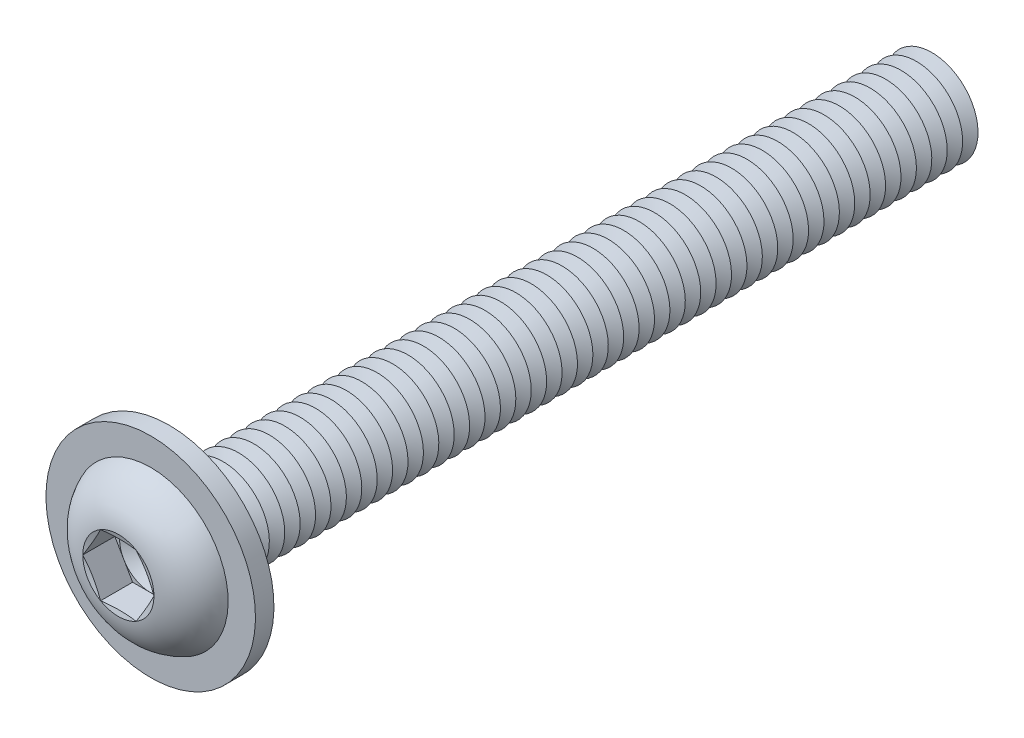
ISO-10303-21;
HEADER;
FILE_DESCRIPTION(('STEP AP214'),'2;1');
FILE_NAME('part.step','',(''),(''),'','','');
FILE_SCHEMA(('AUTOMOTIVE_DESIGN { 1 0 10303 214 1 1 1 1 }'));
ENDSEC;
DATA;
#1=APPLICATION_CONTEXT('core data for automotive mechanical design processes');
#2=APPLICATION_PROTOCOL_DEFINITION('international standard','automotive_design',2000,#1);
#3=PRODUCT_CONTEXT('',#1,'mechanical');
#4=PRODUCT('Part','Part','',(#3));
#5=PRODUCT_RELATED_PRODUCT_CATEGORY('part','',(#4));
#6=PRODUCT_DEFINITION_FORMATION('','',#4);
#7=PRODUCT_DEFINITION_CONTEXT('part definition',#1,'design');
#8=PRODUCT_DEFINITION('design','',#6,#7);
#9=PRODUCT_DEFINITION_SHAPE('','',#8);
#10=(LENGTH_UNIT() NAMED_UNIT(*) SI_UNIT(.MILLI.,.METRE.));
#11=(NAMED_UNIT(*) PLANE_ANGLE_UNIT() SI_UNIT($,.RADIAN.));
#12=(NAMED_UNIT(*) SI_UNIT($,.STERADIAN.) SOLID_ANGLE_UNIT());
#13=UNCERTAINTY_MEASURE_WITH_UNIT(LENGTH_MEASURE(1.E-05),#10,'distance_accuracy_value','');
#14=(GEOMETRIC_REPRESENTATION_CONTEXT(3) GLOBAL_UNCERTAINTY_ASSIGNED_CONTEXT((#13)) GLOBAL_UNIT_ASSIGNED_CONTEXT((#10,
#11,#12)) REPRESENTATION_CONTEXT('',''));
#15=CARTESIAN_POINT('',(0.,0.,0.));
#16=DIRECTION('',(0.,0.,1.));
#17=DIRECTION('',(1.,0.,0.));
#18=AXIS2_PLACEMENT_3D('',#15,#16,#17);
#19=CARTESIAN_POINT('',(0.,0.,-46.5));
#20=DIRECTION('',(0.,0.,1.));
#21=DIRECTION('',(0.,-1.,0.));
#22=AXIS2_PLACEMENT_3D('',#19,#20,#21);
#23=CONICAL_SURFACE('',#22,2.99999999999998,1.0471975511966);
#24=CARTESIAN_POINT('',(0.,0.,-47.));
#25=DIRECTION('',(0.,0.,1.));
#26=DIRECTION('',(0.,-1.,0.));
#27=AXIS2_PLACEMENT_3D('',#24,#25,#26);
#28=CIRCLE('',#27,2.13397459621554);
#29=CARTESIAN_POINT('',(0.,-2.13397459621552,-47.));
#30=VERTEX_POINT('',#29);
#31=EDGE_CURVE('E608',#30,#30,#28,.T.);
#32=ORIENTED_EDGE('',*,*,#31,.T.);
#33=EDGE_LOOP('',(#32));
#34=FACE_BOUND('',#33,.T.);
#35=CARTESIAN_POINT('',(0.,0.,-46.5));
#36=DIRECTION('',(0.,0.,1.));
#37=DIRECTION('',(0.,-1.,0.));
#38=AXIS2_PLACEMENT_3D('',#35,#36,#37);
#39=CIRCLE('',#38,2.99999999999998);
#40=CARTESIAN_POINT('',(0.,-2.99999999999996,-46.5));
#41=VERTEX_POINT('',#40);
#42=EDGE_CURVE('E604',#41,#41,#39,.T.);
#43=ORIENTED_EDGE('',*,*,#42,.F.);
#44=EDGE_LOOP('',(#43));
#45=FACE_BOUND('',#44,.T.);
#46=ADVANCED_FACE('F39',(#34,#45),#23,.T.);
#47=CARTESIAN_POINT('',(0.,0.,-47.));
#48=DIRECTION('',(0.,0.,-1.));
#49=DIRECTION('',(0.,1.,0.));
#50=AXIS2_PLACEMENT_3D('',#47,#48,#49);
#51=CONICAL_SURFACE('',#50,2.13397459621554,1.0471975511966);
#52=CARTESIAN_POINT('',(0.,0.,-47.5));
#53=DIRECTION('',(0.,0.,1.));
#54=DIRECTION('',(0.,-1.,0.));
#55=AXIS2_PLACEMENT_3D('',#52,#53,#54);
#56=CIRCLE('',#55,2.99999999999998);
#57=CARTESIAN_POINT('',(0.,-2.99999999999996,-47.5));
#58=VERTEX_POINT('',#57);
#59=EDGE_CURVE('E612',#58,#58,#56,.T.);
#60=ORIENTED_EDGE('',*,*,#59,.T.);
#61=EDGE_LOOP('',(#60));
#62=FACE_BOUND('',#61,.T.);
#63=ORIENTED_EDGE('',*,*,#31,.F.);
#64=EDGE_LOOP('',(#63));
#65=FACE_BOUND('',#64,.T.);
#66=ADVANCED_FACE('F728',(#62,#65),#51,.T.);
#67=CARTESIAN_POINT('',(0.,2.99999999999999,-50.));
#68=DIRECTION('',(0.,0.,-1.));
#69=DIRECTION('',(0.,1.,0.));
#70=AXIS2_PLACEMENT_3D('',#67,#68,#69);
#71=PLANE('',#70);
#72=CARTESIAN_POINT('',(0.,0.,-50.));
#73=DIRECTION('',(0.,0.,1.));
#74=DIRECTION('',(0.,-1.,0.));
#75=AXIS2_PLACEMENT_3D('',#72,#73,#74);
#76=CIRCLE('',#75,2.13397459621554);
#77=CARTESIAN_POINT('',(0.,-2.13397459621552,-50.));
#78=VERTEX_POINT('',#77);
#79=EDGE_CURVE('E632',#78,#78,#76,.T.);
#80=ORIENTED_EDGE('',*,*,#79,.F.);
#81=EDGE_LOOP('',(#80));
#82=FACE_BOUND('',#81,.T.);
#83=ADVANCED_FACE('F734',(#82),#71,.T.);
#84=CARTESIAN_POINT('',(0.,0.,-49.5));
#85=DIRECTION('',(0.,0.,1.));
#86=DIRECTION('',(0.,-1.,0.));
#87=AXIS2_PLACEMENT_3D('',#84,#85,#86);
#88=CONICAL_SURFACE('',#87,2.99999999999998,1.0471975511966);
#89=ORIENTED_EDGE('',*,*,#79,.T.);
#90=EDGE_LOOP('',(#89));
#91=FACE_BOUND('',#90,.T.);
#92=CARTESIAN_POINT('',(0.,0.,-49.5));
#93=DIRECTION('',(0.,0.,1.));
#94=DIRECTION('',(0.,-1.,0.));
#95=AXIS2_PLACEMENT_3D('',#92,#93,#94);
#96=CIRCLE('',#95,2.99999999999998);
#97=CARTESIAN_POINT('',(0.,-2.99999999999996,-49.5));
#98=VERTEX_POINT('',#97);
#99=EDGE_CURVE('E628',#98,#98,#96,.T.);
#100=ORIENTED_EDGE('',*,*,#99,.F.);
#101=EDGE_LOOP('',(#100));
#102=FACE_BOUND('',#101,.T.);
#103=ADVANCED_FACE('F753',(#91,#102),#88,.T.);
#104=CARTESIAN_POINT('',(0.,0.,-49.));
#105=DIRECTION('',(0.,0.,-1.));
#106=DIRECTION('',(0.,1.,0.));
#107=AXIS2_PLACEMENT_3D('',#104,#105,#106);
#108=CONICAL_SURFACE('',#107,2.13397459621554,1.0471975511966);
#109=ORIENTED_EDGE('',*,*,#99,.T.);
#110=EDGE_LOOP('',(#109));
#111=FACE_BOUND('',#110,.T.);
#112=CARTESIAN_POINT('',(0.,0.,-49.));
#113=DIRECTION('',(0.,0.,1.));
#114=DIRECTION('',(0.,-1.,0.));
#115=AXIS2_PLACEMENT_3D('',#112,#113,#114);
#116=CIRCLE('',#115,2.13397459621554);
#117=CARTESIAN_POINT('',(0.,-2.13397459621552,-49.));
#118=VERTEX_POINT('',#117);
#119=EDGE_CURVE('E624',#118,#118,#116,.T.);
#120=ORIENTED_EDGE('',*,*,#119,.F.);
#121=EDGE_LOOP('',(#120));
#122=FACE_BOUND('',#121,.T.);
#123=ADVANCED_FACE('F750',(#111,#122),#108,.T.);
#124=CARTESIAN_POINT('',(0.,0.,-48.5));
#125=DIRECTION('',(0.,0.,1.));
#126=DIRECTION('',(0.,-1.,0.));
#127=AXIS2_PLACEMENT_3D('',#124,#125,#126);
#128=CONICAL_SURFACE('',#127,2.99999999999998,1.0471975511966);
#129=ORIENTED_EDGE('',*,*,#119,.T.);
#130=EDGE_LOOP('',(#129));
#131=FACE_BOUND('',#130,.T.);
#132=CARTESIAN_POINT('',(0.,0.,-48.5));
#133=DIRECTION('',(0.,0.,1.));
#134=DIRECTION('',(0.,-1.,0.));
#135=AXIS2_PLACEMENT_3D('',#132,#133,#134);
#136=CIRCLE('',#135,2.99999999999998);
#137=CARTESIAN_POINT('',(0.,-2.99999999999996,-48.5));
#138=VERTEX_POINT('',#137);
#139=EDGE_CURVE('E620',#138,#138,#136,.T.);
#140=ORIENTED_EDGE('',*,*,#139,.F.);
#141=EDGE_LOOP('',(#140));
#142=FACE_BOUND('',#141,.T.);
#143=ADVANCED_FACE('F744',(#131,#142),#128,.T.);
#144=CARTESIAN_POINT('',(0.,0.,-48.));
#145=DIRECTION('',(0.,0.,-1.));
#146=DIRECTION('',(0.,1.,0.));
#147=AXIS2_PLACEMENT_3D('',#144,#145,#146);
#148=CONICAL_SURFACE('',#147,2.13397459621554,1.0471975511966);
#149=ORIENTED_EDGE('',*,*,#139,.T.);
#150=EDGE_LOOP('',(#149));
#151=FACE_BOUND('',#150,.T.);
#152=CARTESIAN_POINT('',(0.,0.,-48.));
#153=DIRECTION('',(0.,0.,1.));
#154=DIRECTION('',(0.,-1.,0.));
#155=AXIS2_PLACEMENT_3D('',#152,#153,#154);
#156=CIRCLE('',#155,2.13397459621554);
#157=CARTESIAN_POINT('',(0.,-2.13397459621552,-48.));
#158=VERTEX_POINT('',#157);
#159=EDGE_CURVE('E616',#158,#158,#156,.T.);
#160=ORIENTED_EDGE('',*,*,#159,.F.);
#161=EDGE_LOOP('',(#160));
#162=FACE_BOUND('',#161,.T.);
#163=ADVANCED_FACE('F740',(#151,#162),#148,.T.);
#164=CARTESIAN_POINT('',(0.,0.,-47.5));
#165=DIRECTION('',(0.,0.,1.));
#166=DIRECTION('',(0.,-1.,0.));
#167=AXIS2_PLACEMENT_3D('',#164,#165,#166);
#168=CONICAL_SURFACE('',#167,2.99999999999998,1.0471975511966);
#169=ORIENTED_EDGE('',*,*,#159,.T.);
#170=EDGE_LOOP('',(#169));
#171=FACE_BOUND('',#170,.T.);
#172=ORIENTED_EDGE('',*,*,#59,.F.);
#173=EDGE_LOOP('',(#172));
#174=FACE_BOUND('',#173,.T.);
#175=ADVANCED_FACE('F743',(#171,#174),#168,.T.);
#176=CARTESIAN_POINT('',(0.,0.,-45.5));
#177=DIRECTION('',(0.,0.,1.));
#178=DIRECTION('',(0.,-1.,0.));
#179=AXIS2_PLACEMENT_3D('',#176,#177,#178);
#180=CONICAL_SURFACE('',#179,2.99999999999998,1.0471975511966);
#181=CARTESIAN_POINT('',(0.,0.,-46.));
#182=DIRECTION('',(0.,0.,1.));
#183=DIRECTION('',(0.,-1.,0.));
#184=AXIS2_PLACEMENT_3D('',#181,#182,#183);
#185=CIRCLE('',#184,2.13397459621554);
#186=CARTESIAN_POINT('',(0.,-2.13397459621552,-46.));
#187=VERTEX_POINT('',#186);
#188=EDGE_CURVE('E600',#187,#187,#185,.T.);
#189=ORIENTED_EDGE('',*,*,#188,.T.);
#190=EDGE_LOOP('',(#189));
#191=FACE_BOUND('',#190,.T.);
#192=CARTESIAN_POINT('',(0.,0.,-45.5));
#193=DIRECTION('',(0.,0.,1.));
#194=DIRECTION('',(0.,-1.,0.));
#195=AXIS2_PLACEMENT_3D('',#192,#193,#194);
#196=CIRCLE('',#195,2.99999999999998);
#197=CARTESIAN_POINT('',(0.,-2.99999999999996,-45.5));
#198=VERTEX_POINT('',#197);
#199=EDGE_CURVE('E596',#198,#198,#196,.T.);
#200=ORIENTED_EDGE('',*,*,#199,.F.);
#201=EDGE_LOOP('',(#200));
#202=FACE_BOUND('',#201,.T.);
#203=ADVANCED_FACE('F748',(#191,#202),#180,.T.);
#204=CARTESIAN_POINT('',(0.,0.,-46.));
#205=DIRECTION('',(0.,0.,-1.));
#206=DIRECTION('',(0.,1.,0.));
#207=AXIS2_PLACEMENT_3D('',#204,#205,#206);
#208=CONICAL_SURFACE('',#207,2.13397459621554,1.0471975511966);
#209=ORIENTED_EDGE('',*,*,#42,.T.);
#210=EDGE_LOOP('',(#209));
#211=FACE_BOUND('',#210,.T.);
#212=ORIENTED_EDGE('',*,*,#188,.F.);
#213=EDGE_LOOP('',(#212));
#214=FACE_BOUND('',#213,.T.);
#215=ADVANCED_FACE('F799',(#211,#214),#208,.T.);
#216=CARTESIAN_POINT('',(0.,0.,-44.5));
#217=DIRECTION('',(0.,0.,1.));
#218=DIRECTION('',(0.,-1.,0.));
#219=AXIS2_PLACEMENT_3D('',#216,#217,#218);
#220=CONICAL_SURFACE('',#219,2.99999999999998,1.0471975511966);
#221=CARTESIAN_POINT('',(0.,0.,-45.));
#222=DIRECTION('',(0.,0.,1.));
#223=DIRECTION('',(0.,-1.,0.));
#224=AXIS2_PLACEMENT_3D('',#221,#222,#223);
#225=CIRCLE('',#224,2.13397459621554);
#226=CARTESIAN_POINT('',(0.,-2.13397459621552,-45.));
#227=VERTEX_POINT('',#226);
#228=EDGE_CURVE('E592',#227,#227,#225,.T.);
#229=ORIENTED_EDGE('',*,*,#228,.T.);
#230=EDGE_LOOP('',(#229));
#231=FACE_BOUND('',#230,.T.);
#232=CARTESIAN_POINT('',(0.,0.,-44.5));
#233=DIRECTION('',(0.,0.,1.));
#234=DIRECTION('',(0.,-1.,0.));
#235=AXIS2_PLACEMENT_3D('',#232,#233,#234);
#236=CIRCLE('',#235,2.99999999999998);
#237=CARTESIAN_POINT('',(0.,-2.99999999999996,-44.5));
#238=VERTEX_POINT('',#237);
#239=EDGE_CURVE('E588',#238,#238,#236,.T.);
#240=ORIENTED_EDGE('',*,*,#239,.F.);
#241=EDGE_LOOP('',(#240));
#242=FACE_BOUND('',#241,.T.);
#243=ADVANCED_FACE('F805',(#231,#242),#220,.T.);
#244=CARTESIAN_POINT('',(0.,0.,-45.));
#245=DIRECTION('',(0.,0.,-1.));
#246=DIRECTION('',(0.,1.,0.));
#247=AXIS2_PLACEMENT_3D('',#244,#245,#246);
#248=CONICAL_SURFACE('',#247,2.13397459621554,1.0471975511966);
#249=ORIENTED_EDGE('',*,*,#199,.T.);
#250=EDGE_LOOP('',(#249));
#251=FACE_BOUND('',#250,.T.);
#252=ORIENTED_EDGE('',*,*,#228,.F.);
#253=EDGE_LOOP('',(#252));
#254=FACE_BOUND('',#253,.T.);
#255=ADVANCED_FACE('F812',(#251,#254),#248,.T.);
#256=CARTESIAN_POINT('',(0.,0.,-43.5));
#257=DIRECTION('',(0.,0.,1.));
#258=DIRECTION('',(0.,-1.,0.));
#259=AXIS2_PLACEMENT_3D('',#256,#257,#258);
#260=CONICAL_SURFACE('',#259,2.99999999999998,1.0471975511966);
#261=CARTESIAN_POINT('',(0.,0.,-44.));
#262=DIRECTION('',(0.,0.,1.));
#263=DIRECTION('',(0.,-1.,0.));
#264=AXIS2_PLACEMENT_3D('',#261,#262,#263);
#265=CIRCLE('',#264,2.13397459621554);
#266=CARTESIAN_POINT('',(0.,-2.13397459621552,-44.));
#267=VERTEX_POINT('',#266);
#268=EDGE_CURVE('E584',#267,#267,#265,.T.);
#269=ORIENTED_EDGE('',*,*,#268,.T.);
#270=EDGE_LOOP('',(#269));
#271=FACE_BOUND('',#270,.T.);
#272=CARTESIAN_POINT('',(0.,0.,-43.5));
#273=DIRECTION('',(0.,0.,1.));
#274=DIRECTION('',(0.,-1.,0.));
#275=AXIS2_PLACEMENT_3D('',#272,#273,#274);
#276=CIRCLE('',#275,2.99999999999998);
#277=CARTESIAN_POINT('',(0.,-2.99999999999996,-43.5));
#278=VERTEX_POINT('',#277);
#279=EDGE_CURVE('E580',#278,#278,#276,.T.);
#280=ORIENTED_EDGE('',*,*,#279,.F.);
#281=EDGE_LOOP('',(#280));
#282=FACE_BOUND('',#281,.T.);
#283=ADVANCED_FACE('F819',(#271,#282),#260,.T.);
#284=CARTESIAN_POINT('',(0.,0.,-44.));
#285=DIRECTION('',(0.,0.,-1.));
#286=DIRECTION('',(0.,1.,0.));
#287=AXIS2_PLACEMENT_3D('',#284,#285,#286);
#288=CONICAL_SURFACE('',#287,2.13397459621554,1.0471975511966);
#289=ORIENTED_EDGE('',*,*,#239,.T.);
#290=EDGE_LOOP('',(#289));
#291=FACE_BOUND('',#290,.T.);
#292=ORIENTED_EDGE('',*,*,#268,.F.);
#293=EDGE_LOOP('',(#292));
#294=FACE_BOUND('',#293,.T.);
#295=ADVANCED_FACE('F826',(#291,#294),#288,.T.);
#296=CARTESIAN_POINT('',(0.,0.,-42.5));
#297=DIRECTION('',(0.,0.,1.));
#298=DIRECTION('',(0.,-1.,0.));
#299=AXIS2_PLACEMENT_3D('',#296,#297,#298);
#300=CONICAL_SURFACE('',#299,2.99999999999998,1.0471975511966);
#301=CARTESIAN_POINT('',(0.,0.,-43.));
#302=DIRECTION('',(0.,0.,1.));
#303=DIRECTION('',(0.,-1.,0.));
#304=AXIS2_PLACEMENT_3D('',#301,#302,#303);
#305=CIRCLE('',#304,2.13397459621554);
#306=CARTESIAN_POINT('',(0.,-2.13397459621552,-43.));
#307=VERTEX_POINT('',#306);
#308=EDGE_CURVE('E576',#307,#307,#305,.T.);
#309=ORIENTED_EDGE('',*,*,#308,.T.);
#310=EDGE_LOOP('',(#309));
#311=FACE_BOUND('',#310,.T.);
#312=CARTESIAN_POINT('',(0.,0.,-42.5));
#313=DIRECTION('',(0.,0.,1.));
#314=DIRECTION('',(0.,-1.,0.));
#315=AXIS2_PLACEMENT_3D('',#312,#313,#314);
#316=CIRCLE('',#315,2.99999999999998);
#317=CARTESIAN_POINT('',(0.,-2.99999999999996,-42.5));
#318=VERTEX_POINT('',#317);
#319=EDGE_CURVE('E572',#318,#318,#316,.T.);
#320=ORIENTED_EDGE('',*,*,#319,.F.);
#321=EDGE_LOOP('',(#320));
#322=FACE_BOUND('',#321,.T.);
#323=ADVANCED_FACE('F833',(#311,#322),#300,.T.);
#324=CARTESIAN_POINT('',(0.,0.,-43.));
#325=DIRECTION('',(0.,0.,-1.));
#326=DIRECTION('',(0.,1.,0.));
#327=AXIS2_PLACEMENT_3D('',#324,#325,#326);
#328=CONICAL_SURFACE('',#327,2.13397459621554,1.0471975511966);
#329=ORIENTED_EDGE('',*,*,#279,.T.);
#330=EDGE_LOOP('',(#329));
#331=FACE_BOUND('',#330,.T.);
#332=ORIENTED_EDGE('',*,*,#308,.F.);
#333=EDGE_LOOP('',(#332));
#334=FACE_BOUND('',#333,.T.);
#335=ADVANCED_FACE('F840',(#331,#334),#328,.T.);
#336=CARTESIAN_POINT('',(0.,0.,-41.5));
#337=DIRECTION('',(0.,0.,1.));
#338=DIRECTION('',(0.,-1.,0.));
#339=AXIS2_PLACEMENT_3D('',#336,#337,#338);
#340=CONICAL_SURFACE('',#339,2.99999999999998,1.0471975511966);
#341=CARTESIAN_POINT('',(0.,0.,-42.));
#342=DIRECTION('',(0.,0.,1.));
#343=DIRECTION('',(0.,-1.,0.));
#344=AXIS2_PLACEMENT_3D('',#341,#342,#343);
#345=CIRCLE('',#344,2.13397459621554);
#346=CARTESIAN_POINT('',(0.,-2.13397459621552,-42.));
#347=VERTEX_POINT('',#346);
#348=EDGE_CURVE('E568',#347,#347,#345,.T.);
#349=ORIENTED_EDGE('',*,*,#348,.T.);
#350=EDGE_LOOP('',(#349));
#351=FACE_BOUND('',#350,.T.);
#352=CARTESIAN_POINT('',(0.,0.,-41.5));
#353=DIRECTION('',(0.,0.,1.));
#354=DIRECTION('',(0.,-1.,0.));
#355=AXIS2_PLACEMENT_3D('',#352,#353,#354);
#356=CIRCLE('',#355,2.99999999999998);
#357=CARTESIAN_POINT('',(0.,-2.99999999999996,-41.5));
#358=VERTEX_POINT('',#357);
#359=EDGE_CURVE('E564',#358,#358,#356,.T.);
#360=ORIENTED_EDGE('',*,*,#359,.F.);
#361=EDGE_LOOP('',(#360));
#362=FACE_BOUND('',#361,.T.);
#363=ADVANCED_FACE('F847',(#351,#362),#340,.T.);
#364=CARTESIAN_POINT('',(0.,0.,-42.));
#365=DIRECTION('',(0.,0.,-1.));
#366=DIRECTION('',(0.,1.,0.));
#367=AXIS2_PLACEMENT_3D('',#364,#365,#366);
#368=CONICAL_SURFACE('',#367,2.13397459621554,1.0471975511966);
#369=ORIENTED_EDGE('',*,*,#319,.T.);
#370=EDGE_LOOP('',(#369));
#371=FACE_BOUND('',#370,.T.);
#372=ORIENTED_EDGE('',*,*,#348,.F.);
#373=EDGE_LOOP('',(#372));
#374=FACE_BOUND('',#373,.T.);
#375=ADVANCED_FACE('F854',(#371,#374),#368,.T.);
#376=CARTESIAN_POINT('',(0.,0.,-40.5));
#377=DIRECTION('',(0.,0.,1.));
#378=DIRECTION('',(0.,-1.,0.));
#379=AXIS2_PLACEMENT_3D('',#376,#377,#378);
#380=CONICAL_SURFACE('',#379,2.99999999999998,1.0471975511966);
#381=CARTESIAN_POINT('',(0.,0.,-41.));
#382=DIRECTION('',(0.,0.,1.));
#383=DIRECTION('',(0.,-1.,0.));
#384=AXIS2_PLACEMENT_3D('',#381,#382,#383);
#385=CIRCLE('',#384,2.13397459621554);
#386=CARTESIAN_POINT('',(0.,-2.13397459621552,-41.));
#387=VERTEX_POINT('',#386);
#388=EDGE_CURVE('E560',#387,#387,#385,.T.);
#389=ORIENTED_EDGE('',*,*,#388,.T.);
#390=EDGE_LOOP('',(#389));
#391=FACE_BOUND('',#390,.T.);
#392=CARTESIAN_POINT('',(0.,0.,-40.5));
#393=DIRECTION('',(0.,0.,1.));
#394=DIRECTION('',(0.,-1.,0.));
#395=AXIS2_PLACEMENT_3D('',#392,#393,#394);
#396=CIRCLE('',#395,2.99999999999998);
#397=CARTESIAN_POINT('',(0.,-2.99999999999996,-40.5));
#398=VERTEX_POINT('',#397);
#399=EDGE_CURVE('E556',#398,#398,#396,.T.);
#400=ORIENTED_EDGE('',*,*,#399,.F.);
#401=EDGE_LOOP('',(#400));
#402=FACE_BOUND('',#401,.T.);
#403=ADVANCED_FACE('F861',(#391,#402),#380,.T.);
#404=CARTESIAN_POINT('',(0.,0.,-41.));
#405=DIRECTION('',(0.,0.,-1.));
#406=DIRECTION('',(0.,1.,0.));
#407=AXIS2_PLACEMENT_3D('',#404,#405,#406);
#408=CONICAL_SURFACE('',#407,2.13397459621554,1.0471975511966);
#409=ORIENTED_EDGE('',*,*,#359,.T.);
#410=EDGE_LOOP('',(#409));
#411=FACE_BOUND('',#410,.T.);
#412=ORIENTED_EDGE('',*,*,#388,.F.);
#413=EDGE_LOOP('',(#412));
#414=FACE_BOUND('',#413,.T.);
#415=ADVANCED_FACE('F868',(#411,#414),#408,.T.);
#416=CARTESIAN_POINT('',(0.,0.,-39.5));
#417=DIRECTION('',(0.,0.,1.));
#418=DIRECTION('',(0.,-1.,0.));
#419=AXIS2_PLACEMENT_3D('',#416,#417,#418);
#420=CONICAL_SURFACE('',#419,2.99999999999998,1.0471975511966);
#421=CARTESIAN_POINT('',(0.,0.,-40.));
#422=DIRECTION('',(0.,0.,1.));
#423=DIRECTION('',(0.,-1.,0.));
#424=AXIS2_PLACEMENT_3D('',#421,#422,#423);
#425=CIRCLE('',#424,2.13397459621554);
#426=CARTESIAN_POINT('',(0.,-2.13397459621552,-40.));
#427=VERTEX_POINT('',#426);
#428=EDGE_CURVE('E552',#427,#427,#425,.T.);
#429=ORIENTED_EDGE('',*,*,#428,.T.);
#430=EDGE_LOOP('',(#429));
#431=FACE_BOUND('',#430,.T.);
#432=CARTESIAN_POINT('',(0.,0.,-39.5));
#433=DIRECTION('',(0.,0.,1.));
#434=DIRECTION('',(0.,-1.,0.));
#435=AXIS2_PLACEMENT_3D('',#432,#433,#434);
#436=CIRCLE('',#435,2.99999999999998);
#437=CARTESIAN_POINT('',(0.,-2.99999999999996,-39.5));
#438=VERTEX_POINT('',#437);
#439=EDGE_CURVE('E548',#438,#438,#436,.T.);
#440=ORIENTED_EDGE('',*,*,#439,.F.);
#441=EDGE_LOOP('',(#440));
#442=FACE_BOUND('',#441,.T.);
#443=ADVANCED_FACE('F875',(#431,#442),#420,.T.);
#444=CARTESIAN_POINT('',(0.,0.,-40.));
#445=DIRECTION('',(0.,0.,-1.));
#446=DIRECTION('',(0.,1.,0.));
#447=AXIS2_PLACEMENT_3D('',#444,#445,#446);
#448=CONICAL_SURFACE('',#447,2.13397459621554,1.0471975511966);
#449=ORIENTED_EDGE('',*,*,#399,.T.);
#450=EDGE_LOOP('',(#449));
#451=FACE_BOUND('',#450,.T.);
#452=ORIENTED_EDGE('',*,*,#428,.F.);
#453=EDGE_LOOP('',(#452));
#454=FACE_BOUND('',#453,.T.);
#455=ADVANCED_FACE('F882',(#451,#454),#448,.T.);
#456=CARTESIAN_POINT('',(0.,0.,-38.5));
#457=DIRECTION('',(0.,0.,1.));
#458=DIRECTION('',(0.,-1.,0.));
#459=AXIS2_PLACEMENT_3D('',#456,#457,#458);
#460=CONICAL_SURFACE('',#459,2.99999999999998,1.0471975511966);
#461=CARTESIAN_POINT('',(0.,0.,-39.));
#462=DIRECTION('',(0.,0.,1.));
#463=DIRECTION('',(0.,-1.,0.));
#464=AXIS2_PLACEMENT_3D('',#461,#462,#463);
#465=CIRCLE('',#464,2.13397459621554);
#466=CARTESIAN_POINT('',(0.,-2.13397459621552,-39.));
#467=VERTEX_POINT('',#466);
#468=EDGE_CURVE('E544',#467,#467,#465,.T.);
#469=ORIENTED_EDGE('',*,*,#468,.T.);
#470=EDGE_LOOP('',(#469));
#471=FACE_BOUND('',#470,.T.);
#472=CARTESIAN_POINT('',(0.,0.,-38.5));
#473=DIRECTION('',(0.,0.,1.));
#474=DIRECTION('',(0.,-1.,0.));
#475=AXIS2_PLACEMENT_3D('',#472,#473,#474);
#476=CIRCLE('',#475,2.99999999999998);
#477=CARTESIAN_POINT('',(0.,-2.99999999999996,-38.5));
#478=VERTEX_POINT('',#477);
#479=EDGE_CURVE('E540',#478,#478,#476,.T.);
#480=ORIENTED_EDGE('',*,*,#479,.F.);
#481=EDGE_LOOP('',(#480));
#482=FACE_BOUND('',#481,.T.);
#483=ADVANCED_FACE('F889',(#471,#482),#460,.T.);
#484=CARTESIAN_POINT('',(0.,0.,-39.));
#485=DIRECTION('',(0.,0.,-1.));
#486=DIRECTION('',(0.,1.,0.));
#487=AXIS2_PLACEMENT_3D('',#484,#485,#486);
#488=CONICAL_SURFACE('',#487,2.13397459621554,1.0471975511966);
#489=ORIENTED_EDGE('',*,*,#439,.T.);
#490=EDGE_LOOP('',(#489));
#491=FACE_BOUND('',#490,.T.);
#492=ORIENTED_EDGE('',*,*,#468,.F.);
#493=EDGE_LOOP('',(#492));
#494=FACE_BOUND('',#493,.T.);
#495=ADVANCED_FACE('F896',(#491,#494),#488,.T.);
#496=CARTESIAN_POINT('',(0.,0.,-37.5));
#497=DIRECTION('',(0.,0.,1.));
#498=DIRECTION('',(0.,-1.,0.));
#499=AXIS2_PLACEMENT_3D('',#496,#497,#498);
#500=CONICAL_SURFACE('',#499,2.99999999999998,1.0471975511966);
#501=CARTESIAN_POINT('',(0.,0.,-38.));
#502=DIRECTION('',(0.,0.,1.));
#503=DIRECTION('',(0.,-1.,0.));
#504=AXIS2_PLACEMENT_3D('',#501,#502,#503);
#505=CIRCLE('',#504,2.13397459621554);
#506=CARTESIAN_POINT('',(0.,-2.13397459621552,-38.));
#507=VERTEX_POINT('',#506);
#508=EDGE_CURVE('E536',#507,#507,#505,.T.);
#509=ORIENTED_EDGE('',*,*,#508,.T.);
#510=EDGE_LOOP('',(#509));
#511=FACE_BOUND('',#510,.T.);
#512=CARTESIAN_POINT('',(0.,0.,-37.5));
#513=DIRECTION('',(0.,0.,1.));
#514=DIRECTION('',(0.,-1.,0.));
#515=AXIS2_PLACEMENT_3D('',#512,#513,#514);
#516=CIRCLE('',#515,2.99999999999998);
#517=CARTESIAN_POINT('',(0.,-2.99999999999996,-37.5));
#518=VERTEX_POINT('',#517);
#519=EDGE_CURVE('E532',#518,#518,#516,.T.);
#520=ORIENTED_EDGE('',*,*,#519,.F.);
#521=EDGE_LOOP('',(#520));
#522=FACE_BOUND('',#521,.T.);
#523=ADVANCED_FACE('F903',(#511,#522),#500,.T.);
#524=CARTESIAN_POINT('',(0.,0.,-38.));
#525=DIRECTION('',(0.,0.,-1.));
#526=DIRECTION('',(0.,1.,0.));
#527=AXIS2_PLACEMENT_3D('',#524,#525,#526);
#528=CONICAL_SURFACE('',#527,2.13397459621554,1.0471975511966);
#529=ORIENTED_EDGE('',*,*,#479,.T.);
#530=EDGE_LOOP('',(#529));
#531=FACE_BOUND('',#530,.T.);
#532=ORIENTED_EDGE('',*,*,#508,.F.);
#533=EDGE_LOOP('',(#532));
#534=FACE_BOUND('',#533,.T.);
#535=ADVANCED_FACE('F910',(#531,#534),#528,.T.);
#536=CARTESIAN_POINT('',(0.,0.,-36.5));
#537=DIRECTION('',(0.,0.,1.));
#538=DIRECTION('',(0.,-1.,0.));
#539=AXIS2_PLACEMENT_3D('',#536,#537,#538);
#540=CONICAL_SURFACE('',#539,2.99999999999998,1.0471975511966);
#541=CARTESIAN_POINT('',(0.,0.,-37.));
#542=DIRECTION('',(0.,0.,1.));
#543=DIRECTION('',(0.,-1.,0.));
#544=AXIS2_PLACEMENT_3D('',#541,#542,#543);
#545=CIRCLE('',#544,2.13397459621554);
#546=CARTESIAN_POINT('',(0.,-2.13397459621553,-37.));
#547=VERTEX_POINT('',#546);
#548=EDGE_CURVE('E528',#547,#547,#545,.T.);
#549=ORIENTED_EDGE('',*,*,#548,.T.);
#550=EDGE_LOOP('',(#549));
#551=FACE_BOUND('',#550,.T.);
#552=CARTESIAN_POINT('',(0.,0.,-36.5));
#553=DIRECTION('',(0.,0.,1.));
#554=DIRECTION('',(0.,-1.,0.));
#555=AXIS2_PLACEMENT_3D('',#552,#553,#554);
#556=CIRCLE('',#555,2.99999999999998);
#557=CARTESIAN_POINT('',(0.,-2.99999999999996,-36.5));
#558=VERTEX_POINT('',#557);
#559=EDGE_CURVE('E525',#558,#558,#556,.T.);
#560=ORIENTED_EDGE('',*,*,#559,.F.);
#561=EDGE_LOOP('',(#560));
#562=FACE_BOUND('',#561,.T.);
#563=ADVANCED_FACE('F917',(#551,#562),#540,.T.);
#564=CARTESIAN_POINT('',(0.,0.,-37.));
#565=DIRECTION('',(0.,0.,-1.));
#566=DIRECTION('',(0.,1.,0.));
#567=AXIS2_PLACEMENT_3D('',#564,#565,#566);
#568=CONICAL_SURFACE('',#567,2.13397459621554,1.0471975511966);
#569=ORIENTED_EDGE('',*,*,#519,.T.);
#570=EDGE_LOOP('',(#569));
#571=FACE_BOUND('',#570,.T.);
#572=ORIENTED_EDGE('',*,*,#548,.F.);
#573=EDGE_LOOP('',(#572));
#574=FACE_BOUND('',#573,.T.);
#575=ADVANCED_FACE('F924',(#571,#574),#568,.T.);
#576=CARTESIAN_POINT('',(0.,0.,-35.5));
#577=DIRECTION('',(0.,0.,1.));
#578=DIRECTION('',(0.,-1.,0.));
#579=AXIS2_PLACEMENT_3D('',#576,#577,#578);
#580=CONICAL_SURFACE('',#579,2.99999999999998,1.0471975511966);
#581=CARTESIAN_POINT('',(0.,0.,-36.));
#582=DIRECTION('',(0.,0.,1.));
#583=DIRECTION('',(0.,-1.,0.));
#584=AXIS2_PLACEMENT_3D('',#581,#582,#583);
#585=CIRCLE('',#584,2.13397459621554);
#586=CARTESIAN_POINT('',(0.,-2.13397459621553,-36.));
#587=VERTEX_POINT('',#586);
#588=EDGE_CURVE('E521',#587,#587,#585,.T.);
#589=ORIENTED_EDGE('',*,*,#588,.T.);
#590=EDGE_LOOP('',(#589));
#591=FACE_BOUND('',#590,.T.);
#592=CARTESIAN_POINT('',(0.,0.,-35.5));
#593=DIRECTION('',(0.,0.,1.));
#594=DIRECTION('',(0.,-1.,0.));
#595=AXIS2_PLACEMENT_3D('',#592,#593,#594);
#596=CIRCLE('',#595,2.99999999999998);
#597=CARTESIAN_POINT('',(0.,-2.99999999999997,-35.5));
#598=VERTEX_POINT('',#597);
#599=EDGE_CURVE('E517',#598,#598,#596,.T.);
#600=ORIENTED_EDGE('',*,*,#599,.F.);
#601=EDGE_LOOP('',(#600));
#602=FACE_BOUND('',#601,.T.);
#603=ADVANCED_FACE('F931',(#591,#602),#580,.T.);
#604=CARTESIAN_POINT('',(0.,0.,-36.));
#605=DIRECTION('',(0.,0.,-1.));
#606=DIRECTION('',(0.,1.,0.));
#607=AXIS2_PLACEMENT_3D('',#604,#605,#606);
#608=CONICAL_SURFACE('',#607,2.13397459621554,1.0471975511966);
#609=ORIENTED_EDGE('',*,*,#559,.T.);
#610=EDGE_LOOP('',(#609));
#611=FACE_BOUND('',#610,.T.);
#612=ORIENTED_EDGE('',*,*,#588,.F.);
#613=EDGE_LOOP('',(#612));
#614=FACE_BOUND('',#613,.T.);
#615=ADVANCED_FACE('F938',(#611,#614),#608,.T.);
#616=CARTESIAN_POINT('',(0.,0.,-34.5));
#617=DIRECTION('',(0.,0.,1.));
#618=DIRECTION('',(0.,-1.,0.));
#619=AXIS2_PLACEMENT_3D('',#616,#617,#618);
#620=CONICAL_SURFACE('',#619,2.99999999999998,1.0471975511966);
#621=CARTESIAN_POINT('',(0.,0.,-35.));
#622=DIRECTION('',(0.,0.,1.));
#623=DIRECTION('',(0.,-1.,0.));
#624=AXIS2_PLACEMENT_3D('',#621,#622,#623);
#625=CIRCLE('',#624,2.13397459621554);
#626=CARTESIAN_POINT('',(0.,-2.13397459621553,-35.));
#627=VERTEX_POINT('',#626);
#628=EDGE_CURVE('E513',#627,#627,#625,.T.);
#629=ORIENTED_EDGE('',*,*,#628,.T.);
#630=EDGE_LOOP('',(#629));
#631=FACE_BOUND('',#630,.T.);
#632=CARTESIAN_POINT('',(0.,0.,-34.5));
#633=DIRECTION('',(0.,0.,1.));
#634=DIRECTION('',(0.,-1.,0.));
#635=AXIS2_PLACEMENT_3D('',#632,#633,#634);
#636=CIRCLE('',#635,2.99999999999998);
#637=CARTESIAN_POINT('',(0.,-2.99999999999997,-34.5));
#638=VERTEX_POINT('',#637);
#639=EDGE_CURVE('E509',#638,#638,#636,.T.);
#640=ORIENTED_EDGE('',*,*,#639,.F.);
#641=EDGE_LOOP('',(#640));
#642=FACE_BOUND('',#641,.T.);
#643=ADVANCED_FACE('F945',(#631,#642),#620,.T.);
#644=CARTESIAN_POINT('',(0.,0.,-35.));
#645=DIRECTION('',(0.,0.,-1.));
#646=DIRECTION('',(0.,1.,0.));
#647=AXIS2_PLACEMENT_3D('',#644,#645,#646);
#648=CONICAL_SURFACE('',#647,2.13397459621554,1.0471975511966);
#649=ORIENTED_EDGE('',*,*,#599,.T.);
#650=EDGE_LOOP('',(#649));
#651=FACE_BOUND('',#650,.T.);
#652=ORIENTED_EDGE('',*,*,#628,.F.);
#653=EDGE_LOOP('',(#652));
#654=FACE_BOUND('',#653,.T.);
#655=ADVANCED_FACE('F952',(#651,#654),#648,.T.);
#656=CARTESIAN_POINT('',(0.,0.,-33.5));
#657=DIRECTION('',(0.,0.,1.));
#658=DIRECTION('',(0.,-1.,0.));
#659=AXIS2_PLACEMENT_3D('',#656,#657,#658);
#660=CONICAL_SURFACE('',#659,2.99999999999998,1.0471975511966);
#661=CARTESIAN_POINT('',(0.,0.,-34.));
#662=DIRECTION('',(0.,0.,1.));
#663=DIRECTION('',(0.,-1.,0.));
#664=AXIS2_PLACEMENT_3D('',#661,#662,#663);
#665=CIRCLE('',#664,2.13397459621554);
#666=CARTESIAN_POINT('',(0.,-2.13397459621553,-34.));
#667=VERTEX_POINT('',#666);
#668=EDGE_CURVE('E505',#667,#667,#665,.T.);
#669=ORIENTED_EDGE('',*,*,#668,.T.);
#670=EDGE_LOOP('',(#669));
#671=FACE_BOUND('',#670,.T.);
#672=CARTESIAN_POINT('',(0.,0.,-33.5));
#673=DIRECTION('',(0.,0.,1.));
#674=DIRECTION('',(0.,-1.,0.));
#675=AXIS2_PLACEMENT_3D('',#672,#673,#674);
#676=CIRCLE('',#675,2.99999999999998);
#677=CARTESIAN_POINT('',(0.,-2.99999999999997,-33.5));
#678=VERTEX_POINT('',#677);
#679=EDGE_CURVE('E501',#678,#678,#676,.T.);
#680=ORIENTED_EDGE('',*,*,#679,.F.);
#681=EDGE_LOOP('',(#680));
#682=FACE_BOUND('',#681,.T.);
#683=ADVANCED_FACE('F959',(#671,#682),#660,.T.);
#684=CARTESIAN_POINT('',(0.,0.,-34.));
#685=DIRECTION('',(0.,0.,-1.));
#686=DIRECTION('',(0.,1.,0.));
#687=AXIS2_PLACEMENT_3D('',#684,#685,#686);
#688=CONICAL_SURFACE('',#687,2.13397459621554,1.0471975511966);
#689=ORIENTED_EDGE('',*,*,#639,.T.);
#690=EDGE_LOOP('',(#689));
#691=FACE_BOUND('',#690,.T.);
#692=ORIENTED_EDGE('',*,*,#668,.F.);
#693=EDGE_LOOP('',(#692));
#694=FACE_BOUND('',#693,.T.);
#695=ADVANCED_FACE('F966',(#691,#694),#688,.T.);
#696=CARTESIAN_POINT('',(0.,0.,-32.5));
#697=DIRECTION('',(0.,0.,1.));
#698=DIRECTION('',(0.,-1.,0.));
#699=AXIS2_PLACEMENT_3D('',#696,#697,#698);
#700=CONICAL_SURFACE('',#699,2.99999999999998,1.0471975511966);
#701=CARTESIAN_POINT('',(0.,0.,-33.));
#702=DIRECTION('',(0.,0.,1.));
#703=DIRECTION('',(0.,-1.,0.));
#704=AXIS2_PLACEMENT_3D('',#701,#702,#703);
#705=CIRCLE('',#704,2.13397459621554);
#706=CARTESIAN_POINT('',(0.,-2.13397459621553,-33.));
#707=VERTEX_POINT('',#706);
#708=EDGE_CURVE('E497',#707,#707,#705,.T.);
#709=ORIENTED_EDGE('',*,*,#708,.T.);
#710=EDGE_LOOP('',(#709));
#711=FACE_BOUND('',#710,.T.);
#712=CARTESIAN_POINT('',(0.,0.,-32.5));
#713=DIRECTION('',(0.,0.,1.));
#714=DIRECTION('',(0.,-1.,0.));
#715=AXIS2_PLACEMENT_3D('',#712,#713,#714);
#716=CIRCLE('',#715,2.99999999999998);
#717=CARTESIAN_POINT('',(0.,-2.99999999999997,-32.5));
#718=VERTEX_POINT('',#717);
#719=EDGE_CURVE('E493',#718,#718,#716,.T.);
#720=ORIENTED_EDGE('',*,*,#719,.F.);
#721=EDGE_LOOP('',(#720));
#722=FACE_BOUND('',#721,.T.);
#723=ADVANCED_FACE('F973',(#711,#722),#700,.T.);
#724=CARTESIAN_POINT('',(0.,0.,-33.));
#725=DIRECTION('',(0.,0.,-1.));
#726=DIRECTION('',(0.,1.,0.));
#727=AXIS2_PLACEMENT_3D('',#724,#725,#726);
#728=CONICAL_SURFACE('',#727,2.13397459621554,1.0471975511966);
#729=ORIENTED_EDGE('',*,*,#679,.T.);
#730=EDGE_LOOP('',(#729));
#731=FACE_BOUND('',#730,.T.);
#732=ORIENTED_EDGE('',*,*,#708,.F.);
#733=EDGE_LOOP('',(#732));
#734=FACE_BOUND('',#733,.T.);
#735=ADVANCED_FACE('F980',(#731,#734),#728,.T.);
#736=CARTESIAN_POINT('',(0.,0.,-31.5));
#737=DIRECTION('',(0.,0.,1.));
#738=DIRECTION('',(0.,-1.,0.));
#739=AXIS2_PLACEMENT_3D('',#736,#737,#738);
#740=CONICAL_SURFACE('',#739,2.99999999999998,1.0471975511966);
#741=CARTESIAN_POINT('',(0.,0.,-32.));
#742=DIRECTION('',(0.,0.,1.));
#743=DIRECTION('',(0.,-1.,0.));
#744=AXIS2_PLACEMENT_3D('',#741,#742,#743);
#745=CIRCLE('',#744,2.13397459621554);
#746=CARTESIAN_POINT('',(0.,-2.13397459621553,-32.));
#747=VERTEX_POINT('',#746);
#748=EDGE_CURVE('E489',#747,#747,#745,.T.);
#749=ORIENTED_EDGE('',*,*,#748,.T.);
#750=EDGE_LOOP('',(#749));
#751=FACE_BOUND('',#750,.T.);
#752=CARTESIAN_POINT('',(0.,0.,-31.5));
#753=DIRECTION('',(0.,0.,1.));
#754=DIRECTION('',(0.,-1.,0.));
#755=AXIS2_PLACEMENT_3D('',#752,#753,#754);
#756=CIRCLE('',#755,2.99999999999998);
#757=CARTESIAN_POINT('',(0.,-2.99999999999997,-31.5));
#758=VERTEX_POINT('',#757);
#759=EDGE_CURVE('E485',#758,#758,#756,.T.);
#760=ORIENTED_EDGE('',*,*,#759,.F.);
#761=EDGE_LOOP('',(#760));
#762=FACE_BOUND('',#761,.T.);
#763=ADVANCED_FACE('F987',(#751,#762),#740,.T.);
#764=CARTESIAN_POINT('',(0.,0.,-32.));
#765=DIRECTION('',(0.,0.,-1.));
#766=DIRECTION('',(0.,1.,0.));
#767=AXIS2_PLACEMENT_3D('',#764,#765,#766);
#768=CONICAL_SURFACE('',#767,2.13397459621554,1.0471975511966);
#769=ORIENTED_EDGE('',*,*,#719,.T.);
#770=EDGE_LOOP('',(#769));
#771=FACE_BOUND('',#770,.T.);
#772=ORIENTED_EDGE('',*,*,#748,.F.);
#773=EDGE_LOOP('',(#772));
#774=FACE_BOUND('',#773,.T.);
#775=ADVANCED_FACE('F994',(#771,#774),#768,.T.);
#776=CARTESIAN_POINT('',(0.,0.,-30.5));
#777=DIRECTION('',(0.,0.,1.));
#778=DIRECTION('',(0.,-1.,0.));
#779=AXIS2_PLACEMENT_3D('',#776,#777,#778);
#780=CONICAL_SURFACE('',#779,2.99999999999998,1.0471975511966);
#781=CARTESIAN_POINT('',(0.,0.,-31.));
#782=DIRECTION('',(0.,0.,1.));
#783=DIRECTION('',(0.,-1.,0.));
#784=AXIS2_PLACEMENT_3D('',#781,#782,#783);
#785=CIRCLE('',#784,2.13397459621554);
#786=CARTESIAN_POINT('',(0.,-2.13397459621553,-31.));
#787=VERTEX_POINT('',#786);
#788=EDGE_CURVE('E481',#787,#787,#785,.T.);
#789=ORIENTED_EDGE('',*,*,#788,.T.);
#790=EDGE_LOOP('',(#789));
#791=FACE_BOUND('',#790,.T.);
#792=CARTESIAN_POINT('',(0.,0.,-30.5));
#793=DIRECTION('',(0.,0.,1.));
#794=DIRECTION('',(0.,-1.,0.));
#795=AXIS2_PLACEMENT_3D('',#792,#793,#794);
#796=CIRCLE('',#795,2.99999999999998);
#797=CARTESIAN_POINT('',(0.,-2.99999999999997,-30.5));
#798=VERTEX_POINT('',#797);
#799=EDGE_CURVE('E477',#798,#798,#796,.T.);
#800=ORIENTED_EDGE('',*,*,#799,.F.);
#801=EDGE_LOOP('',(#800));
#802=FACE_BOUND('',#801,.T.);
#803=ADVANCED_FACE('F1001',(#791,#802),#780,.T.);
#804=CARTESIAN_POINT('',(0.,0.,-31.));
#805=DIRECTION('',(0.,0.,-1.));
#806=DIRECTION('',(0.,1.,0.));
#807=AXIS2_PLACEMENT_3D('',#804,#805,#806);
#808=CONICAL_SURFACE('',#807,2.13397459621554,1.0471975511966);
#809=ORIENTED_EDGE('',*,*,#759,.T.);
#810=EDGE_LOOP('',(#809));
#811=FACE_BOUND('',#810,.T.);
#812=ORIENTED_EDGE('',*,*,#788,.F.);
#813=EDGE_LOOP('',(#812));
#814=FACE_BOUND('',#813,.T.);
#815=ADVANCED_FACE('F1008',(#811,#814),#808,.T.);
#816=CARTESIAN_POINT('',(0.,0.,-29.5));
#817=DIRECTION('',(0.,0.,1.));
#818=DIRECTION('',(0.,-1.,0.));
#819=AXIS2_PLACEMENT_3D('',#816,#817,#818);
#820=CONICAL_SURFACE('',#819,2.99999999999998,1.0471975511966);
#821=CARTESIAN_POINT('',(0.,0.,-30.));
#822=DIRECTION('',(0.,0.,1.));
#823=DIRECTION('',(0.,-1.,0.));
#824=AXIS2_PLACEMENT_3D('',#821,#822,#823);
#825=CIRCLE('',#824,2.13397459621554);
#826=CARTESIAN_POINT('',(0.,-2.13397459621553,-30.));
#827=VERTEX_POINT('',#826);
#828=EDGE_CURVE('E473',#827,#827,#825,.T.);
#829=ORIENTED_EDGE('',*,*,#828,.T.);
#830=EDGE_LOOP('',(#829));
#831=FACE_BOUND('',#830,.T.);
#832=CARTESIAN_POINT('',(0.,0.,-29.5));
#833=DIRECTION('',(0.,0.,1.));
#834=DIRECTION('',(0.,-1.,0.));
#835=AXIS2_PLACEMENT_3D('',#832,#833,#834);
#836=CIRCLE('',#835,2.99999999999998);
#837=CARTESIAN_POINT('',(0.,-2.99999999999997,-29.5));
#838=VERTEX_POINT('',#837);
#839=EDGE_CURVE('E469',#838,#838,#836,.T.);
#840=ORIENTED_EDGE('',*,*,#839,.F.);
#841=EDGE_LOOP('',(#840));
#842=FACE_BOUND('',#841,.T.);
#843=ADVANCED_FACE('F1015',(#831,#842),#820,.T.);
#844=CARTESIAN_POINT('',(0.,0.,-30.));
#845=DIRECTION('',(0.,0.,-1.));
#846=DIRECTION('',(0.,1.,0.));
#847=AXIS2_PLACEMENT_3D('',#844,#845,#846);
#848=CONICAL_SURFACE('',#847,2.13397459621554,1.0471975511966);
#849=ORIENTED_EDGE('',*,*,#799,.T.);
#850=EDGE_LOOP('',(#849));
#851=FACE_BOUND('',#850,.T.);
#852=ORIENTED_EDGE('',*,*,#828,.F.);
#853=EDGE_LOOP('',(#852));
#854=FACE_BOUND('',#853,.T.);
#855=ADVANCED_FACE('F1022',(#851,#854),#848,.T.);
#856=CARTESIAN_POINT('',(0.,0.,-28.5));
#857=DIRECTION('',(0.,0.,1.));
#858=DIRECTION('',(0.,-1.,0.));
#859=AXIS2_PLACEMENT_3D('',#856,#857,#858);
#860=CONICAL_SURFACE('',#859,2.99999999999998,1.0471975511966);
#861=CARTESIAN_POINT('',(0.,0.,-29.));
#862=DIRECTION('',(0.,0.,1.));
#863=DIRECTION('',(0.,-1.,0.));
#864=AXIS2_PLACEMENT_3D('',#861,#862,#863);
#865=CIRCLE('',#864,2.13397459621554);
#866=CARTESIAN_POINT('',(0.,-2.13397459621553,-29.));
#867=VERTEX_POINT('',#866);
#868=EDGE_CURVE('E465',#867,#867,#865,.T.);
#869=ORIENTED_EDGE('',*,*,#868,.T.);
#870=EDGE_LOOP('',(#869));
#871=FACE_BOUND('',#870,.T.);
#872=CARTESIAN_POINT('',(0.,0.,-28.5));
#873=DIRECTION('',(0.,0.,1.));
#874=DIRECTION('',(0.,-1.,0.));
#875=AXIS2_PLACEMENT_3D('',#872,#873,#874);
#876=CIRCLE('',#875,2.99999999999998);
#877=CARTESIAN_POINT('',(0.,-2.99999999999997,-28.5));
#878=VERTEX_POINT('',#877);
#879=EDGE_CURVE('E461',#878,#878,#876,.T.);
#880=ORIENTED_EDGE('',*,*,#879,.F.);
#881=EDGE_LOOP('',(#880));
#882=FACE_BOUND('',#881,.T.);
#883=ADVANCED_FACE('F1029',(#871,#882),#860,.T.);
#884=CARTESIAN_POINT('',(0.,0.,-29.));
#885=DIRECTION('',(0.,0.,-1.));
#886=DIRECTION('',(0.,1.,0.));
#887=AXIS2_PLACEMENT_3D('',#884,#885,#886);
#888=CONICAL_SURFACE('',#887,2.13397459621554,1.0471975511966);
#889=ORIENTED_EDGE('',*,*,#839,.T.);
#890=EDGE_LOOP('',(#889));
#891=FACE_BOUND('',#890,.T.);
#892=ORIENTED_EDGE('',*,*,#868,.F.);
#893=EDGE_LOOP('',(#892));
#894=FACE_BOUND('',#893,.T.);
#895=ADVANCED_FACE('F1036',(#891,#894),#888,.T.);
#896=CARTESIAN_POINT('',(0.,0.,-27.5));
#897=DIRECTION('',(0.,0.,1.));
#898=DIRECTION('',(0.,-1.,0.));
#899=AXIS2_PLACEMENT_3D('',#896,#897,#898);
#900=CONICAL_SURFACE('',#899,2.99999999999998,1.0471975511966);
#901=CARTESIAN_POINT('',(0.,0.,-28.));
#902=DIRECTION('',(0.,0.,1.));
#903=DIRECTION('',(0.,-1.,0.));
#904=AXIS2_PLACEMENT_3D('',#901,#902,#903);
#905=CIRCLE('',#904,2.13397459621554);
#906=CARTESIAN_POINT('',(0.,-2.13397459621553,-28.));
#907=VERTEX_POINT('',#906);
#908=EDGE_CURVE('E457',#907,#907,#905,.T.);
#909=ORIENTED_EDGE('',*,*,#908,.T.);
#910=EDGE_LOOP('',(#909));
#911=FACE_BOUND('',#910,.T.);
#912=CARTESIAN_POINT('',(0.,0.,-27.5));
#913=DIRECTION('',(0.,0.,1.));
#914=DIRECTION('',(0.,-1.,0.));
#915=AXIS2_PLACEMENT_3D('',#912,#913,#914);
#916=CIRCLE('',#915,2.99999999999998);
#917=CARTESIAN_POINT('',(0.,-2.99999999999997,-27.5));
#918=VERTEX_POINT('',#917);
#919=EDGE_CURVE('E453',#918,#918,#916,.T.);
#920=ORIENTED_EDGE('',*,*,#919,.F.);
#921=EDGE_LOOP('',(#920));
#922=FACE_BOUND('',#921,.T.);
#923=ADVANCED_FACE('F1043',(#911,#922),#900,.T.);
#924=CARTESIAN_POINT('',(0.,0.,-28.));
#925=DIRECTION('',(0.,0.,-1.));
#926=DIRECTION('',(0.,1.,0.));
#927=AXIS2_PLACEMENT_3D('',#924,#925,#926);
#928=CONICAL_SURFACE('',#927,2.13397459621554,1.0471975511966);
#929=ORIENTED_EDGE('',*,*,#879,.T.);
#930=EDGE_LOOP('',(#929));
#931=FACE_BOUND('',#930,.T.);
#932=ORIENTED_EDGE('',*,*,#908,.F.);
#933=EDGE_LOOP('',(#932));
#934=FACE_BOUND('',#933,.T.);
#935=ADVANCED_FACE('F1050',(#931,#934),#928,.T.);
#936=CARTESIAN_POINT('',(0.,0.,-26.5));
#937=DIRECTION('',(0.,0.,1.));
#938=DIRECTION('',(0.,-1.,0.));
#939=AXIS2_PLACEMENT_3D('',#936,#937,#938);
#940=CONICAL_SURFACE('',#939,2.99999999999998,1.0471975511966);
#941=CARTESIAN_POINT('',(0.,0.,-27.));
#942=DIRECTION('',(0.,0.,1.));
#943=DIRECTION('',(0.,-1.,0.));
#944=AXIS2_PLACEMENT_3D('',#941,#942,#943);
#945=CIRCLE('',#944,2.13397459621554);
#946=CARTESIAN_POINT('',(0.,-2.13397459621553,-27.));
#947=VERTEX_POINT('',#946);
#948=EDGE_CURVE('E449',#947,#947,#945,.T.);
#949=ORIENTED_EDGE('',*,*,#948,.T.);
#950=EDGE_LOOP('',(#949));
#951=FACE_BOUND('',#950,.T.);
#952=CARTESIAN_POINT('',(0.,0.,-26.5));
#953=DIRECTION('',(0.,0.,1.));
#954=DIRECTION('',(0.,-1.,0.));
#955=AXIS2_PLACEMENT_3D('',#952,#953,#954);
#956=CIRCLE('',#955,2.99999999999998);
#957=CARTESIAN_POINT('',(0.,-2.99999999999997,-26.5));
#958=VERTEX_POINT('',#957);
#959=EDGE_CURVE('E445',#958,#958,#956,.T.);
#960=ORIENTED_EDGE('',*,*,#959,.F.);
#961=EDGE_LOOP('',(#960));
#962=FACE_BOUND('',#961,.T.);
#963=ADVANCED_FACE('F1057',(#951,#962),#940,.T.);
#964=CARTESIAN_POINT('',(0.,0.,-27.));
#965=DIRECTION('',(0.,0.,-1.));
#966=DIRECTION('',(0.,1.,0.));
#967=AXIS2_PLACEMENT_3D('',#964,#965,#966);
#968=CONICAL_SURFACE('',#967,2.13397459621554,1.0471975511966);
#969=ORIENTED_EDGE('',*,*,#919,.T.);
#970=EDGE_LOOP('',(#969));
#971=FACE_BOUND('',#970,.T.);
#972=ORIENTED_EDGE('',*,*,#948,.F.);
#973=EDGE_LOOP('',(#972));
#974=FACE_BOUND('',#973,.T.);
#975=ADVANCED_FACE('F1064',(#971,#974),#968,.T.);
#976=CARTESIAN_POINT('',(0.,0.,-25.5));
#977=DIRECTION('',(0.,0.,1.));
#978=DIRECTION('',(0.,-1.,0.));
#979=AXIS2_PLACEMENT_3D('',#976,#977,#978);
#980=CONICAL_SURFACE('',#979,2.99999999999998,1.0471975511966);
#981=CARTESIAN_POINT('',(0.,0.,-26.));
#982=DIRECTION('',(0.,0.,1.));
#983=DIRECTION('',(0.,-1.,0.));
#984=AXIS2_PLACEMENT_3D('',#981,#982,#983);
#985=CIRCLE('',#984,2.13397459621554);
#986=CARTESIAN_POINT('',(0.,-2.13397459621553,-26.));
#987=VERTEX_POINT('',#986);
#988=EDGE_CURVE('E441',#987,#987,#985,.T.);
#989=ORIENTED_EDGE('',*,*,#988,.T.);
#990=EDGE_LOOP('',(#989));
#991=FACE_BOUND('',#990,.T.);
#992=CARTESIAN_POINT('',(0.,0.,-25.5));
#993=DIRECTION('',(0.,0.,1.));
#994=DIRECTION('',(0.,-1.,0.));
#995=AXIS2_PLACEMENT_3D('',#992,#993,#994);
#996=CIRCLE('',#995,2.99999999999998);
#997=CARTESIAN_POINT('',(0.,-2.99999999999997,-25.5));
#998=VERTEX_POINT('',#997);
#999=EDGE_CURVE('E437',#998,#998,#996,.T.);
#1000=ORIENTED_EDGE('',*,*,#999,.F.);
#1001=EDGE_LOOP('',(#1000));
#1002=FACE_BOUND('',#1001,.T.);
#1003=ADVANCED_FACE('F1071',(#991,#1002),#980,.T.);
#1004=CARTESIAN_POINT('',(0.,0.,-26.));
#1005=DIRECTION('',(0.,0.,-1.));
#1006=DIRECTION('',(0.,1.,0.));
#1007=AXIS2_PLACEMENT_3D('',#1004,#1005,#1006);
#1008=CONICAL_SURFACE('',#1007,2.13397459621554,1.0471975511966);
#1009=ORIENTED_EDGE('',*,*,#959,.T.);
#1010=EDGE_LOOP('',(#1009));
#1011=FACE_BOUND('',#1010,.T.);
#1012=ORIENTED_EDGE('',*,*,#988,.F.);
#1013=EDGE_LOOP('',(#1012));
#1014=FACE_BOUND('',#1013,.T.);
#1015=ADVANCED_FACE('F1078',(#1011,#1014),#1008,.T.);
#1016=CARTESIAN_POINT('',(0.,0.,-24.5));
#1017=DIRECTION('',(0.,0.,1.));
#1018=DIRECTION('',(0.,-1.,0.));
#1019=AXIS2_PLACEMENT_3D('',#1016,#1017,#1018);
#1020=CONICAL_SURFACE('',#1019,2.99999999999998,1.0471975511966);
#1021=CARTESIAN_POINT('',(0.,0.,-25.));
#1022=DIRECTION('',(0.,0.,1.));
#1023=DIRECTION('',(0.,-1.,0.));
#1024=AXIS2_PLACEMENT_3D('',#1021,#1022,#1023);
#1025=CIRCLE('',#1024,2.13397459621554);
#1026=CARTESIAN_POINT('',(0.,-2.13397459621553,-25.));
#1027=VERTEX_POINT('',#1026);
#1028=EDGE_CURVE('E433',#1027,#1027,#1025,.T.);
#1029=ORIENTED_EDGE('',*,*,#1028,.T.);
#1030=EDGE_LOOP('',(#1029));
#1031=FACE_BOUND('',#1030,.T.);
#1032=CARTESIAN_POINT('',(0.,0.,-24.5));
#1033=DIRECTION('',(0.,0.,1.));
#1034=DIRECTION('',(0.,-1.,0.));
#1035=AXIS2_PLACEMENT_3D('',#1032,#1033,#1034);
#1036=CIRCLE('',#1035,2.99999999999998);
#1037=CARTESIAN_POINT('',(0.,-2.99999999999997,-24.5));
#1038=VERTEX_POINT('',#1037);
#1039=EDGE_CURVE('E429',#1038,#1038,#1036,.T.);
#1040=ORIENTED_EDGE('',*,*,#1039,.F.);
#1041=EDGE_LOOP('',(#1040));
#1042=FACE_BOUND('',#1041,.T.);
#1043=ADVANCED_FACE('F1085',(#1031,#1042),#1020,.T.);
#1044=CARTESIAN_POINT('',(0.,0.,-25.));
#1045=DIRECTION('',(0.,0.,-1.));
#1046=DIRECTION('',(0.,1.,0.));
#1047=AXIS2_PLACEMENT_3D('',#1044,#1045,#1046);
#1048=CONICAL_SURFACE('',#1047,2.13397459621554,1.0471975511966);
#1049=ORIENTED_EDGE('',*,*,#999,.T.);
#1050=EDGE_LOOP('',(#1049));
#1051=FACE_BOUND('',#1050,.T.);
#1052=ORIENTED_EDGE('',*,*,#1028,.F.);
#1053=EDGE_LOOP('',(#1052));
#1054=FACE_BOUND('',#1053,.T.);
#1055=ADVANCED_FACE('F1092',(#1051,#1054),#1048,.T.);
#1056=CARTESIAN_POINT('',(0.,0.,-23.5));
#1057=DIRECTION('',(0.,0.,1.));
#1058=DIRECTION('',(0.,-1.,0.));
#1059=AXIS2_PLACEMENT_3D('',#1056,#1057,#1058);
#1060=CONICAL_SURFACE('',#1059,2.99999999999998,1.0471975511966);
#1061=CARTESIAN_POINT('',(0.,0.,-24.));
#1062=DIRECTION('',(0.,0.,1.));
#1063=DIRECTION('',(0.,-1.,0.));
#1064=AXIS2_PLACEMENT_3D('',#1061,#1062,#1063);
#1065=CIRCLE('',#1064,2.13397459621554);
#1066=CARTESIAN_POINT('',(0.,-2.13397459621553,-24.));
#1067=VERTEX_POINT('',#1066);
#1068=EDGE_CURVE('E425',#1067,#1067,#1065,.T.);
#1069=ORIENTED_EDGE('',*,*,#1068,.T.);
#1070=EDGE_LOOP('',(#1069));
#1071=FACE_BOUND('',#1070,.T.);
#1072=CARTESIAN_POINT('',(0.,0.,-23.5));
#1073=DIRECTION('',(0.,0.,1.));
#1074=DIRECTION('',(0.,-1.,0.));
#1075=AXIS2_PLACEMENT_3D('',#1072,#1073,#1074);
#1076=CIRCLE('',#1075,2.99999999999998);
#1077=CARTESIAN_POINT('',(0.,-2.99999999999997,-23.5));
#1078=VERTEX_POINT('',#1077);
#1079=EDGE_CURVE('E421',#1078,#1078,#1076,.T.);
#1080=ORIENTED_EDGE('',*,*,#1079,.F.);
#1081=EDGE_LOOP('',(#1080));
#1082=FACE_BOUND('',#1081,.T.);
#1083=ADVANCED_FACE('F1099',(#1071,#1082),#1060,.T.);
#1084=CARTESIAN_POINT('',(0.,0.,-24.));
#1085=DIRECTION('',(0.,0.,-1.));
#1086=DIRECTION('',(0.,1.,0.));
#1087=AXIS2_PLACEMENT_3D('',#1084,#1085,#1086);
#1088=CONICAL_SURFACE('',#1087,2.13397459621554,1.0471975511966);
#1089=ORIENTED_EDGE('',*,*,#1039,.T.);
#1090=EDGE_LOOP('',(#1089));
#1091=FACE_BOUND('',#1090,.T.);
#1092=ORIENTED_EDGE('',*,*,#1068,.F.);
#1093=EDGE_LOOP('',(#1092));
#1094=FACE_BOUND('',#1093,.T.);
#1095=ADVANCED_FACE('F1106',(#1091,#1094),#1088,.T.);
#1096=CARTESIAN_POINT('',(0.,0.,-22.5));
#1097=DIRECTION('',(0.,0.,1.));
#1098=DIRECTION('',(0.,-1.,0.));
#1099=AXIS2_PLACEMENT_3D('',#1096,#1097,#1098);
#1100=CONICAL_SURFACE('',#1099,2.99999999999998,1.0471975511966);
#1101=CARTESIAN_POINT('',(0.,0.,-23.));
#1102=DIRECTION('',(0.,0.,1.));
#1103=DIRECTION('',(0.,-1.,0.));
#1104=AXIS2_PLACEMENT_3D('',#1101,#1102,#1103);
#1105=CIRCLE('',#1104,2.13397459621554);
#1106=CARTESIAN_POINT('',(0.,-2.13397459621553,-23.));
#1107=VERTEX_POINT('',#1106);
#1108=EDGE_CURVE('E417',#1107,#1107,#1105,.T.);
#1109=ORIENTED_EDGE('',*,*,#1108,.T.);
#1110=EDGE_LOOP('',(#1109));
#1111=FACE_BOUND('',#1110,.T.);
#1112=CARTESIAN_POINT('',(0.,0.,-22.5));
#1113=DIRECTION('',(0.,0.,1.));
#1114=DIRECTION('',(0.,-1.,0.));
#1115=AXIS2_PLACEMENT_3D('',#1112,#1113,#1114);
#1116=CIRCLE('',#1115,2.99999999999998);
#1117=CARTESIAN_POINT('',(0.,-2.99999999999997,-22.5));
#1118=VERTEX_POINT('',#1117);
#1119=EDGE_CURVE('E413',#1118,#1118,#1116,.T.);
#1120=ORIENTED_EDGE('',*,*,#1119,.F.);
#1121=EDGE_LOOP('',(#1120));
#1122=FACE_BOUND('',#1121,.T.);
#1123=ADVANCED_FACE('F1113',(#1111,#1122),#1100,.T.);
#1124=CARTESIAN_POINT('',(0.,0.,-23.));
#1125=DIRECTION('',(0.,0.,-1.));
#1126=DIRECTION('',(0.,1.,0.));
#1127=AXIS2_PLACEMENT_3D('',#1124,#1125,#1126);
#1128=CONICAL_SURFACE('',#1127,2.13397459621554,1.0471975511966);
#1129=ORIENTED_EDGE('',*,*,#1079,.T.);
#1130=EDGE_LOOP('',(#1129));
#1131=FACE_BOUND('',#1130,.T.);
#1132=ORIENTED_EDGE('',*,*,#1108,.F.);
#1133=EDGE_LOOP('',(#1132));
#1134=FACE_BOUND('',#1133,.T.);
#1135=ADVANCED_FACE('F1120',(#1131,#1134),#1128,.T.);
#1136=CARTESIAN_POINT('',(0.,0.,-21.5));
#1137=DIRECTION('',(0.,0.,1.));
#1138=DIRECTION('',(0.,-1.,0.));
#1139=AXIS2_PLACEMENT_3D('',#1136,#1137,#1138);
#1140=CONICAL_SURFACE('',#1139,2.99999999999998,1.0471975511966);
#1141=CARTESIAN_POINT('',(0.,0.,-22.));
#1142=DIRECTION('',(0.,0.,1.));
#1143=DIRECTION('',(0.,-1.,0.));
#1144=AXIS2_PLACEMENT_3D('',#1141,#1142,#1143);
#1145=CIRCLE('',#1144,2.13397459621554);
#1146=CARTESIAN_POINT('',(0.,-2.13397459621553,-22.));
#1147=VERTEX_POINT('',#1146);
#1148=EDGE_CURVE('E409',#1147,#1147,#1145,.T.);
#1149=ORIENTED_EDGE('',*,*,#1148,.T.);
#1150=EDGE_LOOP('',(#1149));
#1151=FACE_BOUND('',#1150,.T.);
#1152=CARTESIAN_POINT('',(0.,0.,-21.5));
#1153=DIRECTION('',(0.,0.,1.));
#1154=DIRECTION('',(0.,-1.,0.));
#1155=AXIS2_PLACEMENT_3D('',#1152,#1153,#1154);
#1156=CIRCLE('',#1155,2.99999999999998);
#1157=CARTESIAN_POINT('',(0.,-2.99999999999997,-21.5));
#1158=VERTEX_POINT('',#1157);
#1159=EDGE_CURVE('E405',#1158,#1158,#1156,.T.);
#1160=ORIENTED_EDGE('',*,*,#1159,.F.);
#1161=EDGE_LOOP('',(#1160));
#1162=FACE_BOUND('',#1161,.T.);
#1163=ADVANCED_FACE('F1127',(#1151,#1162),#1140,.T.);
#1164=CARTESIAN_POINT('',(0.,0.,-22.));
#1165=DIRECTION('',(0.,0.,-1.));
#1166=DIRECTION('',(0.,1.,0.));
#1167=AXIS2_PLACEMENT_3D('',#1164,#1165,#1166);
#1168=CONICAL_SURFACE('',#1167,2.13397459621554,1.0471975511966);
#1169=ORIENTED_EDGE('',*,*,#1119,.T.);
#1170=EDGE_LOOP('',(#1169));
#1171=FACE_BOUND('',#1170,.T.);
#1172=ORIENTED_EDGE('',*,*,#1148,.F.);
#1173=EDGE_LOOP('',(#1172));
#1174=FACE_BOUND('',#1173,.T.);
#1175=ADVANCED_FACE('F1134',(#1171,#1174),#1168,.T.);
#1176=CARTESIAN_POINT('',(0.,0.,-20.5));
#1177=DIRECTION('',(0.,0.,1.));
#1178=DIRECTION('',(0.,-1.,0.));
#1179=AXIS2_PLACEMENT_3D('',#1176,#1177,#1178);
#1180=CONICAL_SURFACE('',#1179,2.99999999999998,1.0471975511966);
#1181=CARTESIAN_POINT('',(0.,0.,-21.));
#1182=DIRECTION('',(0.,0.,1.));
#1183=DIRECTION('',(0.,-1.,0.));
#1184=AXIS2_PLACEMENT_3D('',#1181,#1182,#1183);
#1185=CIRCLE('',#1184,2.13397459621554);
#1186=CARTESIAN_POINT('',(0.,-2.13397459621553,-21.));
#1187=VERTEX_POINT('',#1186);
#1188=EDGE_CURVE('E401',#1187,#1187,#1185,.T.);
#1189=ORIENTED_EDGE('',*,*,#1188,.T.);
#1190=EDGE_LOOP('',(#1189));
#1191=FACE_BOUND('',#1190,.T.);
#1192=CARTESIAN_POINT('',(0.,0.,-20.5));
#1193=DIRECTION('',(0.,0.,1.));
#1194=DIRECTION('',(0.,-1.,0.));
#1195=AXIS2_PLACEMENT_3D('',#1192,#1193,#1194);
#1196=CIRCLE('',#1195,2.99999999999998);
#1197=CARTESIAN_POINT('',(0.,-2.99999999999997,-20.5));
#1198=VERTEX_POINT('',#1197);
#1199=EDGE_CURVE('E397',#1198,#1198,#1196,.T.);
#1200=ORIENTED_EDGE('',*,*,#1199,.F.);
#1201=EDGE_LOOP('',(#1200));
#1202=FACE_BOUND('',#1201,.T.);
#1203=ADVANCED_FACE('F1141',(#1191,#1202),#1180,.T.);
#1204=CARTESIAN_POINT('',(0.,0.,-21.));
#1205=DIRECTION('',(0.,0.,-1.));
#1206=DIRECTION('',(0.,1.,0.));
#1207=AXIS2_PLACEMENT_3D('',#1204,#1205,#1206);
#1208=CONICAL_SURFACE('',#1207,2.13397459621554,1.0471975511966);
#1209=ORIENTED_EDGE('',*,*,#1159,.T.);
#1210=EDGE_LOOP('',(#1209));
#1211=FACE_BOUND('',#1210,.T.);
#1212=ORIENTED_EDGE('',*,*,#1188,.F.);
#1213=EDGE_LOOP('',(#1212));
#1214=FACE_BOUND('',#1213,.T.);
#1215=ADVANCED_FACE('F1148',(#1211,#1214),#1208,.T.);
#1216=CARTESIAN_POINT('',(0.,0.,-19.5));
#1217=DIRECTION('',(0.,0.,1.));
#1218=DIRECTION('',(0.,-1.,0.));
#1219=AXIS2_PLACEMENT_3D('',#1216,#1217,#1218);
#1220=CONICAL_SURFACE('',#1219,2.99999999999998,1.0471975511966);
#1221=CARTESIAN_POINT('',(0.,0.,-20.));
#1222=DIRECTION('',(0.,0.,1.));
#1223=DIRECTION('',(0.,-1.,0.));
#1224=AXIS2_PLACEMENT_3D('',#1221,#1222,#1223);
#1225=CIRCLE('',#1224,2.13397459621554);
#1226=CARTESIAN_POINT('',(0.,-2.13397459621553,-20.));
#1227=VERTEX_POINT('',#1226);
#1228=EDGE_CURVE('E393',#1227,#1227,#1225,.T.);
#1229=ORIENTED_EDGE('',*,*,#1228,.T.);
#1230=EDGE_LOOP('',(#1229));
#1231=FACE_BOUND('',#1230,.T.);
#1232=CARTESIAN_POINT('',(0.,0.,-19.5));
#1233=DIRECTION('',(0.,0.,1.));
#1234=DIRECTION('',(0.,-1.,0.));
#1235=AXIS2_PLACEMENT_3D('',#1232,#1233,#1234);
#1236=CIRCLE('',#1235,2.99999999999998);
#1237=CARTESIAN_POINT('',(0.,-2.99999999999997,-19.5));
#1238=VERTEX_POINT('',#1237);
#1239=EDGE_CURVE('E389',#1238,#1238,#1236,.T.);
#1240=ORIENTED_EDGE('',*,*,#1239,.F.);
#1241=EDGE_LOOP('',(#1240));
#1242=FACE_BOUND('',#1241,.T.);
#1243=ADVANCED_FACE('F1155',(#1231,#1242),#1220,.T.);
#1244=CARTESIAN_POINT('',(0.,0.,-20.));
#1245=DIRECTION('',(0.,0.,-1.));
#1246=DIRECTION('',(0.,1.,0.));
#1247=AXIS2_PLACEMENT_3D('',#1244,#1245,#1246);
#1248=CONICAL_SURFACE('',#1247,2.13397459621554,1.0471975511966);
#1249=ORIENTED_EDGE('',*,*,#1199,.T.);
#1250=EDGE_LOOP('',(#1249));
#1251=FACE_BOUND('',#1250,.T.);
#1252=ORIENTED_EDGE('',*,*,#1228,.F.);
#1253=EDGE_LOOP('',(#1252));
#1254=FACE_BOUND('',#1253,.T.);
#1255=ADVANCED_FACE('F1162',(#1251,#1254),#1248,.T.);
#1256=CARTESIAN_POINT('',(0.,0.,-18.5));
#1257=DIRECTION('',(0.,0.,1.));
#1258=DIRECTION('',(0.,-1.,0.));
#1259=AXIS2_PLACEMENT_3D('',#1256,#1257,#1258);
#1260=CONICAL_SURFACE('',#1259,2.99999999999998,1.0471975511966);
#1261=CARTESIAN_POINT('',(0.,0.,-19.));
#1262=DIRECTION('',(0.,0.,1.));
#1263=DIRECTION('',(0.,-1.,0.));
#1264=AXIS2_PLACEMENT_3D('',#1261,#1262,#1263);
#1265=CIRCLE('',#1264,2.13397459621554);
#1266=CARTESIAN_POINT('',(0.,-2.13397459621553,-19.));
#1267=VERTEX_POINT('',#1266);
#1268=EDGE_CURVE('E385',#1267,#1267,#1265,.T.);
#1269=ORIENTED_EDGE('',*,*,#1268,.T.);
#1270=EDGE_LOOP('',(#1269));
#1271=FACE_BOUND('',#1270,.T.);
#1272=CARTESIAN_POINT('',(0.,0.,-18.5));
#1273=DIRECTION('',(0.,0.,1.));
#1274=DIRECTION('',(0.,-1.,0.));
#1275=AXIS2_PLACEMENT_3D('',#1272,#1273,#1274);
#1276=CIRCLE('',#1275,2.99999999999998);
#1277=CARTESIAN_POINT('',(0.,-2.99999999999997,-18.5));
#1278=VERTEX_POINT('',#1277);
#1279=EDGE_CURVE('E381',#1278,#1278,#1276,.T.);
#1280=ORIENTED_EDGE('',*,*,#1279,.F.);
#1281=EDGE_LOOP('',(#1280));
#1282=FACE_BOUND('',#1281,.T.);
#1283=ADVANCED_FACE('F1169',(#1271,#1282),#1260,.T.);
#1284=CARTESIAN_POINT('',(0.,0.,-19.));
#1285=DIRECTION('',(0.,0.,-1.));
#1286=DIRECTION('',(0.,1.,0.));
#1287=AXIS2_PLACEMENT_3D('',#1284,#1285,#1286);
#1288=CONICAL_SURFACE('',#1287,2.13397459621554,1.0471975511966);
#1289=ORIENTED_EDGE('',*,*,#1239,.T.);
#1290=EDGE_LOOP('',(#1289));
#1291=FACE_BOUND('',#1290,.T.);
#1292=ORIENTED_EDGE('',*,*,#1268,.F.);
#1293=EDGE_LOOP('',(#1292));
#1294=FACE_BOUND('',#1293,.T.);
#1295=ADVANCED_FACE('F1176',(#1291,#1294),#1288,.T.);
#1296=CARTESIAN_POINT('',(0.,0.,-17.5));
#1297=DIRECTION('',(0.,0.,1.));
#1298=DIRECTION('',(0.,-1.,0.));
#1299=AXIS2_PLACEMENT_3D('',#1296,#1297,#1298);
#1300=CONICAL_SURFACE('',#1299,2.99999999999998,1.0471975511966);
#1301=CARTESIAN_POINT('',(0.,0.,-18.));
#1302=DIRECTION('',(0.,0.,1.));
#1303=DIRECTION('',(0.,-1.,0.));
#1304=AXIS2_PLACEMENT_3D('',#1301,#1302,#1303);
#1305=CIRCLE('',#1304,2.13397459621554);
#1306=CARTESIAN_POINT('',(0.,-2.13397459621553,-18.));
#1307=VERTEX_POINT('',#1306);
#1308=EDGE_CURVE('E377',#1307,#1307,#1305,.T.);
#1309=ORIENTED_EDGE('',*,*,#1308,.T.);
#1310=EDGE_LOOP('',(#1309));
#1311=FACE_BOUND('',#1310,.T.);
#1312=CARTESIAN_POINT('',(0.,0.,-17.5));
#1313=DIRECTION('',(0.,0.,1.));
#1314=DIRECTION('',(0.,-1.,0.));
#1315=AXIS2_PLACEMENT_3D('',#1312,#1313,#1314);
#1316=CIRCLE('',#1315,2.99999999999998);
#1317=CARTESIAN_POINT('',(0.,-2.99999999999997,-17.5));
#1318=VERTEX_POINT('',#1317);
#1319=EDGE_CURVE('E373',#1318,#1318,#1316,.T.);
#1320=ORIENTED_EDGE('',*,*,#1319,.F.);
#1321=EDGE_LOOP('',(#1320));
#1322=FACE_BOUND('',#1321,.T.);
#1323=ADVANCED_FACE('F1183',(#1311,#1322),#1300,.T.);
#1324=CARTESIAN_POINT('',(0.,0.,-18.));
#1325=DIRECTION('',(0.,0.,-1.));
#1326=DIRECTION('',(0.,1.,0.));
#1327=AXIS2_PLACEMENT_3D('',#1324,#1325,#1326);
#1328=CONICAL_SURFACE('',#1327,2.13397459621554,1.0471975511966);
#1329=ORIENTED_EDGE('',*,*,#1279,.T.);
#1330=EDGE_LOOP('',(#1329));
#1331=FACE_BOUND('',#1330,.T.);
#1332=ORIENTED_EDGE('',*,*,#1308,.F.);
#1333=EDGE_LOOP('',(#1332));
#1334=FACE_BOUND('',#1333,.T.);
#1335=ADVANCED_FACE('F1190',(#1331,#1334),#1328,.T.);
#1336=CARTESIAN_POINT('',(0.,0.,-16.5));
#1337=DIRECTION('',(0.,0.,1.));
#1338=DIRECTION('',(0.,-1.,0.));
#1339=AXIS2_PLACEMENT_3D('',#1336,#1337,#1338);
#1340=CONICAL_SURFACE('',#1339,2.99999999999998,1.0471975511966);
#1341=CARTESIAN_POINT('',(0.,0.,-17.));
#1342=DIRECTION('',(0.,0.,1.));
#1343=DIRECTION('',(0.,-1.,0.));
#1344=AXIS2_PLACEMENT_3D('',#1341,#1342,#1343);
#1345=CIRCLE('',#1344,2.13397459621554);
#1346=CARTESIAN_POINT('',(0.,-2.13397459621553,-17.));
#1347=VERTEX_POINT('',#1346);
#1348=EDGE_CURVE('E369',#1347,#1347,#1345,.T.);
#1349=ORIENTED_EDGE('',*,*,#1348,.T.);
#1350=EDGE_LOOP('',(#1349));
#1351=FACE_BOUND('',#1350,.T.);
#1352=CARTESIAN_POINT('',(0.,0.,-16.5));
#1353=DIRECTION('',(0.,0.,1.));
#1354=DIRECTION('',(0.,-1.,0.));
#1355=AXIS2_PLACEMENT_3D('',#1352,#1353,#1354);
#1356=CIRCLE('',#1355,2.99999999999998);
#1357=CARTESIAN_POINT('',(0.,-2.99999999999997,-16.5));
#1358=VERTEX_POINT('',#1357);
#1359=EDGE_CURVE('E365',#1358,#1358,#1356,.T.);
#1360=ORIENTED_EDGE('',*,*,#1359,.F.);
#1361=EDGE_LOOP('',(#1360));
#1362=FACE_BOUND('',#1361,.T.);
#1363=ADVANCED_FACE('F1197',(#1351,#1362),#1340,.T.);
#1364=CARTESIAN_POINT('',(0.,0.,-17.));
#1365=DIRECTION('',(0.,0.,-1.));
#1366=DIRECTION('',(0.,1.,0.));
#1367=AXIS2_PLACEMENT_3D('',#1364,#1365,#1366);
#1368=CONICAL_SURFACE('',#1367,2.13397459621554,1.0471975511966);
#1369=ORIENTED_EDGE('',*,*,#1319,.T.);
#1370=EDGE_LOOP('',(#1369));
#1371=FACE_BOUND('',#1370,.T.);
#1372=ORIENTED_EDGE('',*,*,#1348,.F.);
#1373=EDGE_LOOP('',(#1372));
#1374=FACE_BOUND('',#1373,.T.);
#1375=ADVANCED_FACE('F1204',(#1371,#1374),#1368,.T.);
#1376=CARTESIAN_POINT('',(0.,0.,-15.5));
#1377=DIRECTION('',(0.,0.,1.));
#1378=DIRECTION('',(0.,-1.,0.));
#1379=AXIS2_PLACEMENT_3D('',#1376,#1377,#1378);
#1380=CONICAL_SURFACE('',#1379,2.99999999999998,1.0471975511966);
#1381=CARTESIAN_POINT('',(0.,0.,-16.));
#1382=DIRECTION('',(0.,0.,1.));
#1383=DIRECTION('',(0.,-1.,0.));
#1384=AXIS2_PLACEMENT_3D('',#1381,#1382,#1383);
#1385=CIRCLE('',#1384,2.13397459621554);
#1386=CARTESIAN_POINT('',(0.,-2.13397459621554,-16.));
#1387=VERTEX_POINT('',#1386);
#1388=EDGE_CURVE('E361',#1387,#1387,#1385,.T.);
#1389=ORIENTED_EDGE('',*,*,#1388,.T.);
#1390=EDGE_LOOP('',(#1389));
#1391=FACE_BOUND('',#1390,.T.);
#1392=CARTESIAN_POINT('',(0.,0.,-15.5));
#1393=DIRECTION('',(0.,0.,1.));
#1394=DIRECTION('',(0.,-1.,0.));
#1395=AXIS2_PLACEMENT_3D('',#1392,#1393,#1394);
#1396=CIRCLE('',#1395,2.99999999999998);
#1397=CARTESIAN_POINT('',(0.,-2.99999999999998,-15.5));
#1398=VERTEX_POINT('',#1397);
#1399=EDGE_CURVE('E357',#1398,#1398,#1396,.T.);
#1400=ORIENTED_EDGE('',*,*,#1399,.F.);
#1401=EDGE_LOOP('',(#1400));
#1402=FACE_BOUND('',#1401,.T.);
#1403=ADVANCED_FACE('F1211',(#1391,#1402),#1380,.T.);
#1404=CARTESIAN_POINT('',(0.,0.,-16.));
#1405=DIRECTION('',(0.,0.,-1.));
#1406=DIRECTION('',(0.,1.,0.));
#1407=AXIS2_PLACEMENT_3D('',#1404,#1405,#1406);
#1408=CONICAL_SURFACE('',#1407,2.13397459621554,1.0471975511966);
#1409=ORIENTED_EDGE('',*,*,#1359,.T.);
#1410=EDGE_LOOP('',(#1409));
#1411=FACE_BOUND('',#1410,.T.);
#1412=ORIENTED_EDGE('',*,*,#1388,.F.);
#1413=EDGE_LOOP('',(#1412));
#1414=FACE_BOUND('',#1413,.T.);
#1415=ADVANCED_FACE('F1218',(#1411,#1414),#1408,.T.);
#1416=CARTESIAN_POINT('',(0.,0.,-14.5));
#1417=DIRECTION('',(0.,0.,1.));
#1418=DIRECTION('',(0.,-1.,0.));
#1419=AXIS2_PLACEMENT_3D('',#1416,#1417,#1418);
#1420=CONICAL_SURFACE('',#1419,2.99999999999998,1.0471975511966);
#1421=CARTESIAN_POINT('',(0.,0.,-15.));
#1422=DIRECTION('',(0.,0.,1.));
#1423=DIRECTION('',(0.,-1.,0.));
#1424=AXIS2_PLACEMENT_3D('',#1421,#1422,#1423);
#1425=CIRCLE('',#1424,2.13397459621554);
#1426=CARTESIAN_POINT('',(0.,-2.13397459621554,-15.));
#1427=VERTEX_POINT('',#1426);
#1428=EDGE_CURVE('E353',#1427,#1427,#1425,.T.);
#1429=ORIENTED_EDGE('',*,*,#1428,.T.);
#1430=EDGE_LOOP('',(#1429));
#1431=FACE_BOUND('',#1430,.T.);
#1432=CARTESIAN_POINT('',(0.,0.,-14.5));
#1433=DIRECTION('',(0.,0.,1.));
#1434=DIRECTION('',(0.,-1.,0.));
#1435=AXIS2_PLACEMENT_3D('',#1432,#1433,#1434);
#1436=CIRCLE('',#1435,2.99999999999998);
#1437=CARTESIAN_POINT('',(0.,-2.99999999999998,-14.5));
#1438=VERTEX_POINT('',#1437);
#1439=EDGE_CURVE('E349',#1438,#1438,#1436,.T.);
#1440=ORIENTED_EDGE('',*,*,#1439,.F.);
#1441=EDGE_LOOP('',(#1440));
#1442=FACE_BOUND('',#1441,.T.);
#1443=ADVANCED_FACE('F1225',(#1431,#1442),#1420,.T.);
#1444=CARTESIAN_POINT('',(0.,0.,-15.));
#1445=DIRECTION('',(0.,0.,-1.));
#1446=DIRECTION('',(0.,1.,0.));
#1447=AXIS2_PLACEMENT_3D('',#1444,#1445,#1446);
#1448=CONICAL_SURFACE('',#1447,2.13397459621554,1.0471975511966);
#1449=ORIENTED_EDGE('',*,*,#1399,.T.);
#1450=EDGE_LOOP('',(#1449));
#1451=FACE_BOUND('',#1450,.T.);
#1452=ORIENTED_EDGE('',*,*,#1428,.F.);
#1453=EDGE_LOOP('',(#1452));
#1454=FACE_BOUND('',#1453,.T.);
#1455=ADVANCED_FACE('F1232',(#1451,#1454),#1448,.T.);
#1456=CARTESIAN_POINT('',(0.,0.,-13.5));
#1457=DIRECTION('',(0.,0.,1.));
#1458=DIRECTION('',(0.,-1.,0.));
#1459=AXIS2_PLACEMENT_3D('',#1456,#1457,#1458);
#1460=CONICAL_SURFACE('',#1459,2.99999999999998,1.0471975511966);
#1461=CARTESIAN_POINT('',(0.,0.,-14.));
#1462=DIRECTION('',(0.,0.,1.));
#1463=DIRECTION('',(0.,-1.,0.));
#1464=AXIS2_PLACEMENT_3D('',#1461,#1462,#1463);
#1465=CIRCLE('',#1464,2.13397459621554);
#1466=CARTESIAN_POINT('',(0.,-2.13397459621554,-14.));
#1467=VERTEX_POINT('',#1466);
#1468=EDGE_CURVE('E345',#1467,#1467,#1465,.T.);
#1469=ORIENTED_EDGE('',*,*,#1468,.T.);
#1470=EDGE_LOOP('',(#1469));
#1471=FACE_BOUND('',#1470,.T.);
#1472=CARTESIAN_POINT('',(0.,0.,-13.5));
#1473=DIRECTION('',(0.,0.,1.));
#1474=DIRECTION('',(0.,-1.,0.));
#1475=AXIS2_PLACEMENT_3D('',#1472,#1473,#1474);
#1476=CIRCLE('',#1475,2.99999999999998);
#1477=CARTESIAN_POINT('',(0.,-2.99999999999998,-13.5));
#1478=VERTEX_POINT('',#1477);
#1479=EDGE_CURVE('E341',#1478,#1478,#1476,.T.);
#1480=ORIENTED_EDGE('',*,*,#1479,.F.);
#1481=EDGE_LOOP('',(#1480));
#1482=FACE_BOUND('',#1481,.T.);
#1483=ADVANCED_FACE('F1239',(#1471,#1482),#1460,.T.);
#1484=CARTESIAN_POINT('',(0.,0.,-14.));
#1485=DIRECTION('',(0.,0.,-1.));
#1486=DIRECTION('',(0.,1.,0.));
#1487=AXIS2_PLACEMENT_3D('',#1484,#1485,#1486);
#1488=CONICAL_SURFACE('',#1487,2.13397459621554,1.0471975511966);
#1489=ORIENTED_EDGE('',*,*,#1439,.T.);
#1490=EDGE_LOOP('',(#1489));
#1491=FACE_BOUND('',#1490,.T.);
#1492=ORIENTED_EDGE('',*,*,#1468,.F.);
#1493=EDGE_LOOP('',(#1492));
#1494=FACE_BOUND('',#1493,.T.);
#1495=ADVANCED_FACE('F1246',(#1491,#1494),#1488,.T.);
#1496=CARTESIAN_POINT('',(0.,0.,-12.5));
#1497=DIRECTION('',(0.,0.,1.));
#1498=DIRECTION('',(0.,-1.,0.));
#1499=AXIS2_PLACEMENT_3D('',#1496,#1497,#1498);
#1500=CONICAL_SURFACE('',#1499,2.99999999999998,1.0471975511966);
#1501=CARTESIAN_POINT('',(0.,0.,-13.));
#1502=DIRECTION('',(0.,0.,1.));
#1503=DIRECTION('',(0.,-1.,0.));
#1504=AXIS2_PLACEMENT_3D('',#1501,#1502,#1503);
#1505=CIRCLE('',#1504,2.13397459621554);
#1506=CARTESIAN_POINT('',(0.,-2.13397459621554,-13.));
#1507=VERTEX_POINT('',#1506);
#1508=EDGE_CURVE('E337',#1507,#1507,#1505,.T.);
#1509=ORIENTED_EDGE('',*,*,#1508,.T.);
#1510=EDGE_LOOP('',(#1509));
#1511=FACE_BOUND('',#1510,.T.);
#1512=CARTESIAN_POINT('',(0.,0.,-12.5));
#1513=DIRECTION('',(0.,0.,1.));
#1514=DIRECTION('',(0.,-1.,0.));
#1515=AXIS2_PLACEMENT_3D('',#1512,#1513,#1514);
#1516=CIRCLE('',#1515,2.99999999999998);
#1517=CARTESIAN_POINT('',(0.,-2.99999999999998,-12.5));
#1518=VERTEX_POINT('',#1517);
#1519=EDGE_CURVE('E333',#1518,#1518,#1516,.T.);
#1520=ORIENTED_EDGE('',*,*,#1519,.F.);
#1521=EDGE_LOOP('',(#1520));
#1522=FACE_BOUND('',#1521,.T.);
#1523=ADVANCED_FACE('F1253',(#1511,#1522),#1500,.T.);
#1524=CARTESIAN_POINT('',(0.,0.,-13.));
#1525=DIRECTION('',(0.,0.,-1.));
#1526=DIRECTION('',(0.,1.,0.));
#1527=AXIS2_PLACEMENT_3D('',#1524,#1525,#1526);
#1528=CONICAL_SURFACE('',#1527,2.13397459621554,1.0471975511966);
#1529=ORIENTED_EDGE('',*,*,#1479,.T.);
#1530=EDGE_LOOP('',(#1529));
#1531=FACE_BOUND('',#1530,.T.);
#1532=ORIENTED_EDGE('',*,*,#1508,.F.);
#1533=EDGE_LOOP('',(#1532));
#1534=FACE_BOUND('',#1533,.T.);
#1535=ADVANCED_FACE('F1260',(#1531,#1534),#1528,.T.);
#1536=CARTESIAN_POINT('',(0.,0.,-11.5));
#1537=DIRECTION('',(0.,0.,1.));
#1538=DIRECTION('',(0.,-1.,0.));
#1539=AXIS2_PLACEMENT_3D('',#1536,#1537,#1538);
#1540=CONICAL_SURFACE('',#1539,2.99999999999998,1.0471975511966);
#1541=CARTESIAN_POINT('',(0.,0.,-12.));
#1542=DIRECTION('',(0.,0.,1.));
#1543=DIRECTION('',(0.,-1.,0.));
#1544=AXIS2_PLACEMENT_3D('',#1541,#1542,#1543);
#1545=CIRCLE('',#1544,2.13397459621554);
#1546=CARTESIAN_POINT('',(0.,-2.13397459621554,-12.));
#1547=VERTEX_POINT('',#1546);
#1548=EDGE_CURVE('E329',#1547,#1547,#1545,.T.);
#1549=ORIENTED_EDGE('',*,*,#1548,.T.);
#1550=EDGE_LOOP('',(#1549));
#1551=FACE_BOUND('',#1550,.T.);
#1552=CARTESIAN_POINT('',(0.,0.,-11.5));
#1553=DIRECTION('',(0.,0.,1.));
#1554=DIRECTION('',(0.,-1.,0.));
#1555=AXIS2_PLACEMENT_3D('',#1552,#1553,#1554);
#1556=CIRCLE('',#1555,2.99999999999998);
#1557=CARTESIAN_POINT('',(0.,-2.99999999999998,-11.5));
#1558=VERTEX_POINT('',#1557);
#1559=EDGE_CURVE('E325',#1558,#1558,#1556,.T.);
#1560=ORIENTED_EDGE('',*,*,#1559,.F.);
#1561=EDGE_LOOP('',(#1560));
#1562=FACE_BOUND('',#1561,.T.);
#1563=ADVANCED_FACE('F1267',(#1551,#1562),#1540,.T.);
#1564=CARTESIAN_POINT('',(0.,0.,-12.));
#1565=DIRECTION('',(0.,0.,-1.));
#1566=DIRECTION('',(0.,1.,0.));
#1567=AXIS2_PLACEMENT_3D('',#1564,#1565,#1566);
#1568=CONICAL_SURFACE('',#1567,2.13397459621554,1.0471975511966);
#1569=ORIENTED_EDGE('',*,*,#1519,.T.);
#1570=EDGE_LOOP('',(#1569));
#1571=FACE_BOUND('',#1570,.T.);
#1572=ORIENTED_EDGE('',*,*,#1548,.F.);
#1573=EDGE_LOOP('',(#1572));
#1574=FACE_BOUND('',#1573,.T.);
#1575=ADVANCED_FACE('F1274',(#1571,#1574),#1568,.T.);
#1576=CARTESIAN_POINT('',(0.,0.,-10.5));
#1577=DIRECTION('',(0.,0.,1.));
#1578=DIRECTION('',(0.,-1.,0.));
#1579=AXIS2_PLACEMENT_3D('',#1576,#1577,#1578);
#1580=CONICAL_SURFACE('',#1579,2.99999999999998,1.0471975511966);
#1581=CARTESIAN_POINT('',(0.,0.,-11.));
#1582=DIRECTION('',(0.,0.,1.));
#1583=DIRECTION('',(0.,-1.,0.));
#1584=AXIS2_PLACEMENT_3D('',#1581,#1582,#1583);
#1585=CIRCLE('',#1584,2.13397459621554);
#1586=CARTESIAN_POINT('',(0.,-2.13397459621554,-11.));
#1587=VERTEX_POINT('',#1586);
#1588=EDGE_CURVE('E321',#1587,#1587,#1585,.T.);
#1589=ORIENTED_EDGE('',*,*,#1588,.T.);
#1590=EDGE_LOOP('',(#1589));
#1591=FACE_BOUND('',#1590,.T.);
#1592=CARTESIAN_POINT('',(0.,0.,-10.5));
#1593=DIRECTION('',(0.,0.,1.));
#1594=DIRECTION('',(0.,-1.,0.));
#1595=AXIS2_PLACEMENT_3D('',#1592,#1593,#1594);
#1596=CIRCLE('',#1595,2.99999999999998);
#1597=CARTESIAN_POINT('',(0.,-2.99999999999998,-10.5));
#1598=VERTEX_POINT('',#1597);
#1599=EDGE_CURVE('E317',#1598,#1598,#1596,.T.);
#1600=ORIENTED_EDGE('',*,*,#1599,.F.);
#1601=EDGE_LOOP('',(#1600));
#1602=FACE_BOUND('',#1601,.T.);
#1603=ADVANCED_FACE('F1281',(#1591,#1602),#1580,.T.);
#1604=CARTESIAN_POINT('',(0.,0.,-11.));
#1605=DIRECTION('',(0.,0.,-1.));
#1606=DIRECTION('',(0.,1.,0.));
#1607=AXIS2_PLACEMENT_3D('',#1604,#1605,#1606);
#1608=CONICAL_SURFACE('',#1607,2.13397459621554,1.0471975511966);
#1609=ORIENTED_EDGE('',*,*,#1559,.T.);
#1610=EDGE_LOOP('',(#1609));
#1611=FACE_BOUND('',#1610,.T.);
#1612=ORIENTED_EDGE('',*,*,#1588,.F.);
#1613=EDGE_LOOP('',(#1612));
#1614=FACE_BOUND('',#1613,.T.);
#1615=ADVANCED_FACE('F1288',(#1611,#1614),#1608,.T.);
#1616=CARTESIAN_POINT('',(0.,0.,-9.5));
#1617=DIRECTION('',(0.,0.,1.));
#1618=DIRECTION('',(0.,-1.,0.));
#1619=AXIS2_PLACEMENT_3D('',#1616,#1617,#1618);
#1620=CONICAL_SURFACE('',#1619,2.99999999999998,1.0471975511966);
#1621=CARTESIAN_POINT('',(0.,0.,-10.));
#1622=DIRECTION('',(0.,0.,1.));
#1623=DIRECTION('',(0.,-1.,0.));
#1624=AXIS2_PLACEMENT_3D('',#1621,#1622,#1623);
#1625=CIRCLE('',#1624,2.13397459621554);
#1626=CARTESIAN_POINT('',(0.,-2.13397459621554,-10.));
#1627=VERTEX_POINT('',#1626);
#1628=EDGE_CURVE('E313',#1627,#1627,#1625,.T.);
#1629=ORIENTED_EDGE('',*,*,#1628,.T.);
#1630=EDGE_LOOP('',(#1629));
#1631=FACE_BOUND('',#1630,.T.);
#1632=CARTESIAN_POINT('',(0.,0.,-9.5));
#1633=DIRECTION('',(0.,0.,1.));
#1634=DIRECTION('',(0.,-1.,0.));
#1635=AXIS2_PLACEMENT_3D('',#1632,#1633,#1634);
#1636=CIRCLE('',#1635,2.99999999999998);
#1637=CARTESIAN_POINT('',(0.,-2.99999999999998,-9.5));
#1638=VERTEX_POINT('',#1637);
#1639=EDGE_CURVE('E309',#1638,#1638,#1636,.T.);
#1640=ORIENTED_EDGE('',*,*,#1639,.F.);
#1641=EDGE_LOOP('',(#1640));
#1642=FACE_BOUND('',#1641,.T.);
#1643=ADVANCED_FACE('F1295',(#1631,#1642),#1620,.T.);
#1644=CARTESIAN_POINT('',(0.,0.,-10.));
#1645=DIRECTION('',(0.,0.,-1.));
#1646=DIRECTION('',(0.,1.,0.));
#1647=AXIS2_PLACEMENT_3D('',#1644,#1645,#1646);
#1648=CONICAL_SURFACE('',#1647,2.13397459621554,1.0471975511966);
#1649=ORIENTED_EDGE('',*,*,#1599,.T.);
#1650=EDGE_LOOP('',(#1649));
#1651=FACE_BOUND('',#1650,.T.);
#1652=ORIENTED_EDGE('',*,*,#1628,.F.);
#1653=EDGE_LOOP('',(#1652));
#1654=FACE_BOUND('',#1653,.T.);
#1655=ADVANCED_FACE('F1302',(#1651,#1654),#1648,.T.);
#1656=CARTESIAN_POINT('',(0.,0.,-8.5));
#1657=DIRECTION('',(0.,0.,1.));
#1658=DIRECTION('',(0.,-1.,0.));
#1659=AXIS2_PLACEMENT_3D('',#1656,#1657,#1658);
#1660=CONICAL_SURFACE('',#1659,2.99999999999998,1.0471975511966);
#1661=CARTESIAN_POINT('',(0.,0.,-9.));
#1662=DIRECTION('',(0.,0.,1.));
#1663=DIRECTION('',(0.,-1.,0.));
#1664=AXIS2_PLACEMENT_3D('',#1661,#1662,#1663);
#1665=CIRCLE('',#1664,2.13397459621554);
#1666=CARTESIAN_POINT('',(0.,-2.13397459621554,-9.));
#1667=VERTEX_POINT('',#1666);
#1668=EDGE_CURVE('E305',#1667,#1667,#1665,.T.);
#1669=ORIENTED_EDGE('',*,*,#1668,.T.);
#1670=EDGE_LOOP('',(#1669));
#1671=FACE_BOUND('',#1670,.T.);
#1672=CARTESIAN_POINT('',(0.,0.,-8.5));
#1673=DIRECTION('',(0.,0.,1.));
#1674=DIRECTION('',(0.,-1.,0.));
#1675=AXIS2_PLACEMENT_3D('',#1672,#1673,#1674);
#1676=CIRCLE('',#1675,2.99999999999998);
#1677=CARTESIAN_POINT('',(0.,-2.99999999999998,-8.5));
#1678=VERTEX_POINT('',#1677);
#1679=EDGE_CURVE('E301',#1678,#1678,#1676,.T.);
#1680=ORIENTED_EDGE('',*,*,#1679,.F.);
#1681=EDGE_LOOP('',(#1680));
#1682=FACE_BOUND('',#1681,.T.);
#1683=ADVANCED_FACE('F1309',(#1671,#1682),#1660,.T.);
#1684=CARTESIAN_POINT('',(0.,0.,-9.));
#1685=DIRECTION('',(0.,0.,-1.));
#1686=DIRECTION('',(0.,1.,0.));
#1687=AXIS2_PLACEMENT_3D('',#1684,#1685,#1686);
#1688=CONICAL_SURFACE('',#1687,2.13397459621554,1.0471975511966);
#1689=ORIENTED_EDGE('',*,*,#1639,.T.);
#1690=EDGE_LOOP('',(#1689));
#1691=FACE_BOUND('',#1690,.T.);
#1692=ORIENTED_EDGE('',*,*,#1668,.F.);
#1693=EDGE_LOOP('',(#1692));
#1694=FACE_BOUND('',#1693,.T.);
#1695=ADVANCED_FACE('F1316',(#1691,#1694),#1688,.T.);
#1696=CARTESIAN_POINT('',(0.,0.,-7.5));
#1697=DIRECTION('',(0.,0.,1.));
#1698=DIRECTION('',(0.,-1.,0.));
#1699=AXIS2_PLACEMENT_3D('',#1696,#1697,#1698);
#1700=CONICAL_SURFACE('',#1699,2.99999999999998,1.0471975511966);
#1701=CARTESIAN_POINT('',(0.,0.,-8.));
#1702=DIRECTION('',(0.,0.,1.));
#1703=DIRECTION('',(0.,-1.,0.));
#1704=AXIS2_PLACEMENT_3D('',#1701,#1702,#1703);
#1705=CIRCLE('',#1704,2.13397459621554);
#1706=CARTESIAN_POINT('',(0.,-2.13397459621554,-8.));
#1707=VERTEX_POINT('',#1706);
#1708=EDGE_CURVE('E297',#1707,#1707,#1705,.T.);
#1709=ORIENTED_EDGE('',*,*,#1708,.T.);
#1710=EDGE_LOOP('',(#1709));
#1711=FACE_BOUND('',#1710,.T.);
#1712=CARTESIAN_POINT('',(0.,0.,-7.5));
#1713=DIRECTION('',(0.,0.,1.));
#1714=DIRECTION('',(0.,-1.,0.));
#1715=AXIS2_PLACEMENT_3D('',#1712,#1713,#1714);
#1716=CIRCLE('',#1715,2.99999999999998);
#1717=CARTESIAN_POINT('',(0.,-2.99999999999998,-7.5));
#1718=VERTEX_POINT('',#1717);
#1719=EDGE_CURVE('E293',#1718,#1718,#1716,.T.);
#1720=ORIENTED_EDGE('',*,*,#1719,.F.);
#1721=EDGE_LOOP('',(#1720));
#1722=FACE_BOUND('',#1721,.T.);
#1723=ADVANCED_FACE('F1323',(#1711,#1722),#1700,.T.);
#1724=CARTESIAN_POINT('',(0.,0.,-8.));
#1725=DIRECTION('',(0.,0.,-1.));
#1726=DIRECTION('',(0.,1.,0.));
#1727=AXIS2_PLACEMENT_3D('',#1724,#1725,#1726);
#1728=CONICAL_SURFACE('',#1727,2.13397459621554,1.0471975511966);
#1729=ORIENTED_EDGE('',*,*,#1679,.T.);
#1730=EDGE_LOOP('',(#1729));
#1731=FACE_BOUND('',#1730,.T.);
#1732=ORIENTED_EDGE('',*,*,#1708,.F.);
#1733=EDGE_LOOP('',(#1732));
#1734=FACE_BOUND('',#1733,.T.);
#1735=ADVANCED_FACE('F1330',(#1731,#1734),#1728,.T.);
#1736=CARTESIAN_POINT('',(0.,0.,-6.5));
#1737=DIRECTION('',(0.,0.,1.));
#1738=DIRECTION('',(0.,-1.,0.));
#1739=AXIS2_PLACEMENT_3D('',#1736,#1737,#1738);
#1740=CONICAL_SURFACE('',#1739,2.99999999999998,1.0471975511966);
#1741=CARTESIAN_POINT('',(0.,0.,-7.));
#1742=DIRECTION('',(0.,0.,1.));
#1743=DIRECTION('',(0.,-1.,0.));
#1744=AXIS2_PLACEMENT_3D('',#1741,#1742,#1743);
#1745=CIRCLE('',#1744,2.13397459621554);
#1746=CARTESIAN_POINT('',(0.,-2.13397459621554,-7.));
#1747=VERTEX_POINT('',#1746);
#1748=EDGE_CURVE('E289',#1747,#1747,#1745,.T.);
#1749=ORIENTED_EDGE('',*,*,#1748,.T.);
#1750=EDGE_LOOP('',(#1749));
#1751=FACE_BOUND('',#1750,.T.);
#1752=CARTESIAN_POINT('',(0.,0.,-6.50000000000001));
#1753=DIRECTION('',(0.,0.,1.));
#1754=DIRECTION('',(0.,-1.,0.));
#1755=AXIS2_PLACEMENT_3D('',#1752,#1753,#1754);
#1756=CIRCLE('',#1755,2.99999999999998);
#1757=CARTESIAN_POINT('',(0.,-2.99999999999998,-6.50000000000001));
#1758=VERTEX_POINT('',#1757);
#1759=EDGE_CURVE('E285',#1758,#1758,#1756,.T.);
#1760=ORIENTED_EDGE('',*,*,#1759,.F.);
#1761=EDGE_LOOP('',(#1760));
#1762=FACE_BOUND('',#1761,.T.);
#1763=ADVANCED_FACE('F1337',(#1751,#1762),#1740,.T.);
#1764=CARTESIAN_POINT('',(0.,0.,-7.));
#1765=DIRECTION('',(0.,0.,-1.));
#1766=DIRECTION('',(0.,1.,0.));
#1767=AXIS2_PLACEMENT_3D('',#1764,#1765,#1766);
#1768=CONICAL_SURFACE('',#1767,2.13397459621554,1.0471975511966);
#1769=ORIENTED_EDGE('',*,*,#1719,.T.);
#1770=EDGE_LOOP('',(#1769));
#1771=FACE_BOUND('',#1770,.T.);
#1772=ORIENTED_EDGE('',*,*,#1748,.F.);
#1773=EDGE_LOOP('',(#1772));
#1774=FACE_BOUND('',#1773,.T.);
#1775=ADVANCED_FACE('F1344',(#1771,#1774),#1768,.T.);
#1776=CARTESIAN_POINT('',(0.,0.,-5.50000000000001));
#1777=DIRECTION('',(0.,0.,1.));
#1778=DIRECTION('',(0.,-1.,0.));
#1779=AXIS2_PLACEMENT_3D('',#1776,#1777,#1778);
#1780=CONICAL_SURFACE('',#1779,2.99999999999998,1.0471975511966);
#1781=CARTESIAN_POINT('',(0.,0.,-6.00000000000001));
#1782=DIRECTION('',(0.,0.,1.));
#1783=DIRECTION('',(0.,-1.,0.));
#1784=AXIS2_PLACEMENT_3D('',#1781,#1782,#1783);
#1785=CIRCLE('',#1784,2.13397459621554);
#1786=CARTESIAN_POINT('',(0.,-2.13397459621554,-6.00000000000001));
#1787=VERTEX_POINT('',#1786);
#1788=EDGE_CURVE('E281',#1787,#1787,#1785,.T.);
#1789=ORIENTED_EDGE('',*,*,#1788,.T.);
#1790=EDGE_LOOP('',(#1789));
#1791=FACE_BOUND('',#1790,.T.);
#1792=CARTESIAN_POINT('',(0.,0.,-5.50000000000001));
#1793=DIRECTION('',(0.,0.,1.));
#1794=DIRECTION('',(0.,-1.,0.));
#1795=AXIS2_PLACEMENT_3D('',#1792,#1793,#1794);
#1796=CIRCLE('',#1795,2.99999999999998);
#1797=CARTESIAN_POINT('',(0.,-2.99999999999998,-5.50000000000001));
#1798=VERTEX_POINT('',#1797);
#1799=EDGE_CURVE('E277',#1798,#1798,#1796,.T.);
#1800=ORIENTED_EDGE('',*,*,#1799,.F.);
#1801=EDGE_LOOP('',(#1800));
#1802=FACE_BOUND('',#1801,.T.);
#1803=ADVANCED_FACE('F1351',(#1791,#1802),#1780,.T.);
#1804=CARTESIAN_POINT('',(0.,0.,-6.00000000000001));
#1805=DIRECTION('',(0.,0.,-1.));
#1806=DIRECTION('',(0.,1.,0.));
#1807=AXIS2_PLACEMENT_3D('',#1804,#1805,#1806);
#1808=CONICAL_SURFACE('',#1807,2.13397459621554,1.0471975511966);
#1809=ORIENTED_EDGE('',*,*,#1759,.T.);
#1810=EDGE_LOOP('',(#1809));
#1811=FACE_BOUND('',#1810,.T.);
#1812=ORIENTED_EDGE('',*,*,#1788,.F.);
#1813=EDGE_LOOP('',(#1812));
#1814=FACE_BOUND('',#1813,.T.);
#1815=ADVANCED_FACE('F1358',(#1811,#1814),#1808,.T.);
#1816=CARTESIAN_POINT('',(0.,0.,-4.5));
#1817=DIRECTION('',(0.,0.,1.));
#1818=DIRECTION('',(0.,-1.,0.));
#1819=AXIS2_PLACEMENT_3D('',#1816,#1817,#1818);
#1820=CONICAL_SURFACE('',#1819,2.99999999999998,1.0471975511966);
#1821=CARTESIAN_POINT('',(0.,0.,-5.));
#1822=DIRECTION('',(0.,0.,1.));
#1823=DIRECTION('',(0.,-1.,0.));
#1824=AXIS2_PLACEMENT_3D('',#1821,#1822,#1823);
#1825=CIRCLE('',#1824,2.13397459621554);
#1826=CARTESIAN_POINT('',(0.,-2.13397459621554,-5.00000000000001));
#1827=VERTEX_POINT('',#1826);
#1828=EDGE_CURVE('E273',#1827,#1827,#1825,.T.);
#1829=ORIENTED_EDGE('',*,*,#1828,.T.);
#1830=EDGE_LOOP('',(#1829));
#1831=FACE_BOUND('',#1830,.T.);
#1832=CARTESIAN_POINT('',(0.,0.,-4.5));
#1833=DIRECTION('',(0.,0.,1.));
#1834=DIRECTION('',(0.,-1.,0.));
#1835=AXIS2_PLACEMENT_3D('',#1832,#1833,#1834);
#1836=CIRCLE('',#1835,2.99999999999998);
#1837=CARTESIAN_POINT('',(0.,-2.99999999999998,-4.50000000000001));
#1838=VERTEX_POINT('',#1837);
#1839=EDGE_CURVE('E269',#1838,#1838,#1836,.T.);
#1840=ORIENTED_EDGE('',*,*,#1839,.F.);
#1841=EDGE_LOOP('',(#1840));
#1842=FACE_BOUND('',#1841,.T.);
#1843=ADVANCED_FACE('F1365',(#1831,#1842),#1820,.T.);
#1844=CARTESIAN_POINT('',(0.,0.,-5.));
#1845=DIRECTION('',(0.,0.,-1.));
#1846=DIRECTION('',(0.,1.,0.));
#1847=AXIS2_PLACEMENT_3D('',#1844,#1845,#1846);
#1848=CONICAL_SURFACE('',#1847,2.13397459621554,1.0471975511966);
#1849=ORIENTED_EDGE('',*,*,#1799,.T.);
#1850=EDGE_LOOP('',(#1849));
#1851=FACE_BOUND('',#1850,.T.);
#1852=ORIENTED_EDGE('',*,*,#1828,.F.);
#1853=EDGE_LOOP('',(#1852));
#1854=FACE_BOUND('',#1853,.T.);
#1855=ADVANCED_FACE('F1372',(#1851,#1854),#1848,.T.);
#1856=CARTESIAN_POINT('',(0.,0.,-3.5));
#1857=DIRECTION('',(0.,0.,1.));
#1858=DIRECTION('',(0.,-1.,0.));
#1859=AXIS2_PLACEMENT_3D('',#1856,#1857,#1858);
#1860=CONICAL_SURFACE('',#1859,2.99999999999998,1.0471975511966);
#1861=CARTESIAN_POINT('',(0.,0.,-4.));
#1862=DIRECTION('',(0.,0.,1.));
#1863=DIRECTION('',(0.,-1.,0.));
#1864=AXIS2_PLACEMENT_3D('',#1861,#1862,#1863);
#1865=CIRCLE('',#1864,2.13397459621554);
#1866=CARTESIAN_POINT('',(0.,-2.13397459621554,-4.));
#1867=VERTEX_POINT('',#1866);
#1868=EDGE_CURVE('E265',#1867,#1867,#1865,.T.);
#1869=ORIENTED_EDGE('',*,*,#1868,.T.);
#1870=EDGE_LOOP('',(#1869));
#1871=FACE_BOUND('',#1870,.T.);
#1872=CARTESIAN_POINT('',(0.,0.,-3.5));
#1873=DIRECTION('',(0.,0.,1.));
#1874=DIRECTION('',(0.,-1.,0.));
#1875=AXIS2_PLACEMENT_3D('',#1872,#1873,#1874);
#1876=CIRCLE('',#1875,2.99999999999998);
#1877=CARTESIAN_POINT('',(0.,-2.99999999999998,-3.5));
#1878=VERTEX_POINT('',#1877);
#1879=EDGE_CURVE('E261',#1878,#1878,#1876,.T.);
#1880=ORIENTED_EDGE('',*,*,#1879,.F.);
#1881=EDGE_LOOP('',(#1880));
#1882=FACE_BOUND('',#1881,.T.);
#1883=ADVANCED_FACE('F1379',(#1871,#1882),#1860,.T.);
#1884=CARTESIAN_POINT('',(0.,0.,-4.));
#1885=DIRECTION('',(0.,0.,-1.));
#1886=DIRECTION('',(0.,1.,0.));
#1887=AXIS2_PLACEMENT_3D('',#1884,#1885,#1886);
#1888=CONICAL_SURFACE('',#1887,2.13397459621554,1.0471975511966);
#1889=ORIENTED_EDGE('',*,*,#1839,.T.);
#1890=EDGE_LOOP('',(#1889));
#1891=FACE_BOUND('',#1890,.T.);
#1892=ORIENTED_EDGE('',*,*,#1868,.F.);
#1893=EDGE_LOOP('',(#1892));
#1894=FACE_BOUND('',#1893,.T.);
#1895=ADVANCED_FACE('F1386',(#1891,#1894),#1888,.T.);
#1896=CARTESIAN_POINT('',(0.,0.,-2.5));
#1897=DIRECTION('',(0.,0.,1.));
#1898=DIRECTION('',(0.,-1.,0.));
#1899=AXIS2_PLACEMENT_3D('',#1896,#1897,#1898);
#1900=CONICAL_SURFACE('',#1899,2.99999999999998,1.0471975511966);
#1901=CARTESIAN_POINT('',(0.,0.,-3.));
#1902=DIRECTION('',(0.,0.,1.));
#1903=DIRECTION('',(0.,-1.,0.));
#1904=AXIS2_PLACEMENT_3D('',#1901,#1902,#1903);
#1905=CIRCLE('',#1904,2.13397459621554);
#1906=CARTESIAN_POINT('',(0.,-2.13397459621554,-3.));
#1907=VERTEX_POINT('',#1906);
#1908=EDGE_CURVE('E257',#1907,#1907,#1905,.T.);
#1909=ORIENTED_EDGE('',*,*,#1908,.T.);
#1910=EDGE_LOOP('',(#1909));
#1911=FACE_BOUND('',#1910,.T.);
#1912=CARTESIAN_POINT('',(0.,0.,-2.5));
#1913=DIRECTION('',(0.,0.,1.));
#1914=DIRECTION('',(0.,-1.,0.));
#1915=AXIS2_PLACEMENT_3D('',#1912,#1913,#1914);
#1916=CIRCLE('',#1915,2.99999999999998);
#1917=CARTESIAN_POINT('',(0.,-2.99999999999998,-2.5));
#1918=VERTEX_POINT('',#1917);
#1919=EDGE_CURVE('E253',#1918,#1918,#1916,.T.);
#1920=ORIENTED_EDGE('',*,*,#1919,.F.);
#1921=EDGE_LOOP('',(#1920));
#1922=FACE_BOUND('',#1921,.T.);
#1923=ADVANCED_FACE('F1393',(#1911,#1922),#1900,.T.);
#1924=CARTESIAN_POINT('',(0.,0.,-3.));
#1925=DIRECTION('',(0.,0.,-1.));
#1926=DIRECTION('',(0.,1.,0.));
#1927=AXIS2_PLACEMENT_3D('',#1924,#1925,#1926);
#1928=CONICAL_SURFACE('',#1927,2.13397459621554,1.0471975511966);
#1929=ORIENTED_EDGE('',*,*,#1879,.T.);
#1930=EDGE_LOOP('',(#1929));
#1931=FACE_BOUND('',#1930,.T.);
#1932=ORIENTED_EDGE('',*,*,#1908,.F.);
#1933=EDGE_LOOP('',(#1932));
#1934=FACE_BOUND('',#1933,.T.);
#1935=ADVANCED_FACE('F1400',(#1931,#1934),#1928,.T.);
#1936=CARTESIAN_POINT('',(0.,0.,-1.5));
#1937=DIRECTION('',(0.,0.,1.));
#1938=DIRECTION('',(0.,-1.,0.));
#1939=AXIS2_PLACEMENT_3D('',#1936,#1937,#1938);
#1940=CONICAL_SURFACE('',#1939,2.99999999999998,1.0471975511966);
#1941=CARTESIAN_POINT('',(0.,0.,-2.));
#1942=DIRECTION('',(0.,0.,1.));
#1943=DIRECTION('',(0.,-1.,0.));
#1944=AXIS2_PLACEMENT_3D('',#1941,#1942,#1943);
#1945=CIRCLE('',#1944,2.13397459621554);
#1946=CARTESIAN_POINT('',(0.,-2.13397459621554,-2.));
#1947=VERTEX_POINT('',#1946);
#1948=EDGE_CURVE('E249',#1947,#1947,#1945,.T.);
#1949=ORIENTED_EDGE('',*,*,#1948,.T.);
#1950=EDGE_LOOP('',(#1949));
#1951=FACE_BOUND('',#1950,.T.);
#1952=CARTESIAN_POINT('',(0.,0.,-1.5));
#1953=DIRECTION('',(0.,0.,1.));
#1954=DIRECTION('',(0.,-1.,0.));
#1955=AXIS2_PLACEMENT_3D('',#1952,#1953,#1954);
#1956=CIRCLE('',#1955,2.99999999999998);
#1957=CARTESIAN_POINT('',(0.,-2.99999999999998,-1.5));
#1958=VERTEX_POINT('',#1957);
#1959=EDGE_CURVE('E241',#1958,#1958,#1956,.T.);
#1960=ORIENTED_EDGE('',*,*,#1959,.F.);
#1961=EDGE_LOOP('',(#1960));
#1962=FACE_BOUND('',#1961,.T.);
#1963=ADVANCED_FACE('F1407',(#1951,#1962),#1940,.T.);
#1964=CARTESIAN_POINT('',(0.,0.,-2.));
#1965=DIRECTION('',(0.,0.,-1.));
#1966=DIRECTION('',(0.,1.,0.));
#1967=AXIS2_PLACEMENT_3D('',#1964,#1965,#1966);
#1968=CONICAL_SURFACE('',#1967,2.13397459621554,1.0471975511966);
#1969=ORIENTED_EDGE('',*,*,#1919,.T.);
#1970=EDGE_LOOP('',(#1969));
#1971=FACE_BOUND('',#1970,.T.);
#1972=ORIENTED_EDGE('',*,*,#1948,.F.);
#1973=EDGE_LOOP('',(#1972));
#1974=FACE_BOUND('',#1973,.T.);
#1975=ADVANCED_FACE('F1414',(#1971,#1974),#1968,.T.);
#1976=CARTESIAN_POINT('',(0.,0.,-0.5));
#1977=DIRECTION('',(0.,0.,1.));
#1978=DIRECTION('',(0.,-1.,0.));
#1979=AXIS2_PLACEMENT_3D('',#1976,#1977,#1978);
#1980=CONICAL_SURFACE('',#1979,2.99999999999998,1.0471975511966);
#1981=CARTESIAN_POINT('',(0.,0.,-1.));
#1982=DIRECTION('',(0.,0.,1.));
#1983=DIRECTION('',(0.,-1.,0.));
#1984=AXIS2_PLACEMENT_3D('',#1981,#1982,#1983);
#1985=CIRCLE('',#1984,2.13397459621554);
#1986=CARTESIAN_POINT('',(0.,-2.13397459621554,-1.));
#1987=VERTEX_POINT('',#1986);
#1988=EDGE_CURVE('E230',#1987,#1987,#1985,.T.);
#1989=ORIENTED_EDGE('',*,*,#1988,.T.);
#1990=EDGE_LOOP('',(#1989));
#1991=FACE_BOUND('',#1990,.T.);
#1992=CARTESIAN_POINT('',(0.,0.,-0.5));
#1993=DIRECTION('',(0.,0.,1.));
#1994=DIRECTION('',(0.,-1.,0.));
#1995=AXIS2_PLACEMENT_3D('',#1992,#1993,#1994);
#1996=CIRCLE('',#1995,2.99999999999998);
#1997=CARTESIAN_POINT('',(0.,-2.99999999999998,-0.500000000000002));
#1998=VERTEX_POINT('',#1997);
#1999=EDGE_CURVE('E245',#1998,#1998,#1996,.T.);
#2000=ORIENTED_EDGE('',*,*,#1999,.F.);
#2001=EDGE_LOOP('',(#2000));
#2002=FACE_BOUND('',#2001,.T.);
#2003=ADVANCED_FACE('F1421',(#1991,#2002),#1980,.T.);
#2004=CARTESIAN_POINT('',(0.,0.,-1.));
#2005=DIRECTION('',(0.,0.,-1.));
#2006=DIRECTION('',(0.,1.,0.));
#2007=AXIS2_PLACEMENT_3D('',#2004,#2005,#2006);
#2008=CONICAL_SURFACE('',#2007,2.13397459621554,1.0471975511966);
#2009=ORIENTED_EDGE('',*,*,#1959,.T.);
#2010=EDGE_LOOP('',(#2009));
#2011=FACE_BOUND('',#2010,.T.);
#2012=ORIENTED_EDGE('',*,*,#1988,.F.);
#2013=EDGE_LOOP('',(#2012));
#2014=FACE_BOUND('',#2013,.T.);
#2015=ADVANCED_FACE('F219',(#2011,#2014),#2008,.T.);
#2016=CARTESIAN_POINT('',(0.,3.,0.));
#2017=DIRECTION('',(0.,0.,-1.));
#2018=DIRECTION('',(0.,1.,0.));
#2019=AXIS2_PLACEMENT_3D('',#2016,#2017,#2018);
#2020=PLANE('',#2019);
#2021=CARTESIAN_POINT('',(0.,0.,0.));
#2022=DIRECTION('',(0.,0.,-1.));
#2023=DIRECTION('',(0.,1.,0.));
#2024=AXIS2_PLACEMENT_3D('',#2021,#2022,#2023);
#2025=CIRCLE('',#2024,3.49999999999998);
#2026=CARTESIAN_POINT('',(0.,3.49999999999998,0.));
#2027=VERTEX_POINT('',#2026);
#2028=EDGE_CURVE('E641',#2027,#2027,#2025,.F.);
#2029=ORIENTED_EDGE('',*,*,#2028,.T.);
#2030=EDGE_LOOP('',(#2029));
#2031=FACE_BOUND('',#2030,.T.);
#2032=CARTESIAN_POINT('',(0.,0.,0.));
#2033=DIRECTION('',(0.,0.,-1.));
#2034=DIRECTION('',(0.,1.,0.));
#2035=AXIS2_PLACEMENT_3D('',#2032,#2033,#2034);
#2036=CIRCLE('',#2035,6.8);
#2037=CARTESIAN_POINT('',(0.,6.8,0.));
#2038=VERTEX_POINT('',#2037);
#2039=EDGE_CURVE('E2045',#2038,#2038,#2036,.T.);
#2040=ORIENTED_EDGE('',*,*,#2039,.T.);
#2041=EDGE_LOOP('',(#2040));
#2042=FACE_BOUND('',#2041,.T.);
#2043=ADVANCED_FACE('F1433',(#2031,#2042),#2020,.T.);
#2044=CARTESIAN_POINT('',(0.,0.,-0.5));
#2045=DIRECTION('',(0.,0.,-1.));
#2046=DIRECTION('',(0.,1.,0.));
#2047=AXIS2_PLACEMENT_3D('',#2044,#2045,#2046);
#2048=TOROIDAL_SURFACE('',#2047,3.49999999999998,0.5);
#2049=ORIENTED_EDGE('',*,*,#2028,.F.);
#2050=EDGE_LOOP('',(#2049));
#2051=FACE_BOUND('',#2050,.T.);
#2052=ORIENTED_EDGE('',*,*,#1999,.T.);
#2053=EDGE_LOOP('',(#2052));
#2054=FACE_BOUND('',#2053,.T.);
#2055=ADVANCED_FACE('F41',(#2051,#2054),#2048,.F.);
#2056=CARTESIAN_POINT('',(0.,0.,1.2));
#2057=DIRECTION('',(0.,0.,-1.));
#2058=DIRECTION('',(0.,1.,0.));
#2059=AXIS2_PLACEMENT_3D('',#2056,#2057,#2058);
#2060=CYLINDRICAL_SURFACE('',#2059,6.8);
#2061=CARTESIAN_POINT('',(0.,0.,1.2));
#2062=DIRECTION('',(0.,0.,-1.));
#2063=DIRECTION('',(0.,1.,0.));
#2064=AXIS2_PLACEMENT_3D('',#2061,#2062,#2063);
#2065=CIRCLE('',#2064,6.8);
#2066=CARTESIAN_POINT('',(0.,6.8,1.2));
#2067=VERTEX_POINT('',#2066);
#2068=EDGE_CURVE('E2043',#2067,#2067,#2065,.T.);
#2069=ORIENTED_EDGE('',*,*,#2068,.T.);
#2070=EDGE_LOOP('',(#2069));
#2071=FACE_BOUND('',#2070,.T.);
#2072=ORIENTED_EDGE('',*,*,#2039,.F.);
#2073=EDGE_LOOP('',(#2072));
#2074=FACE_BOUND('',#2073,.T.);
#2075=ADVANCED_FACE('F1444',(#2071,#2074),#2060,.T.);
#2076=CARTESIAN_POINT('',(0.,0.,1.2));
#2077=DIRECTION('',(0.,0.,-1.));
#2078=DIRECTION('',(0.,1.,0.));
#2079=AXIS2_PLACEMENT_3D('',#2076,#2077,#2078);
#2080=PLANE('',#2079);
#2081=CARTESIAN_POINT('',(0.,0.,1.2));
#2082=DIRECTION('',(0.,0.,-1.));
#2083=DIRECTION('',(0.,1.,0.));
#2084=AXIS2_PLACEMENT_3D('',#2081,#2082,#2083);
#2085=CIRCLE('',#2084,5.02568742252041);
#2086=CARTESIAN_POINT('',(0.,5.02568742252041,1.2));
#2087=VERTEX_POINT('',#2086);
#2088=EDGE_CURVE('E43',#2087,#2087,#2085,.F.);
#2089=ORIENTED_EDGE('',*,*,#2088,.F.);
#2090=EDGE_LOOP('',(#2089));
#2091=FACE_BOUND('',#2090,.T.);
#2092=ORIENTED_EDGE('',*,*,#2068,.F.);
#2093=EDGE_LOOP('',(#2092));
#2094=FACE_BOUND('',#2093,.T.);
#2095=ADVANCED_FACE('F117',(#2091,#2094),#2080,.F.);
#2096=CARTESIAN_POINT('',(0.,0.,1.22));
#2097=DIRECTION('',(0.,0.,1.));
#2098=DIRECTION('',(1.,0.,0.));
#2099=AXIS2_PLACEMENT_3D('',#2096,#2097,#2098);
#2100=CONICAL_SURFACE('',#2099,1.99999906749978,1.0471975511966);
#2101=CARTESIAN_POINT('',(0.,0.,0.0653000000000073));
#2102=VERTEX_POINT('',#2101);
#2103=VERTEX_LOOP('',#2102);
#2104=FACE_BOUND('',#2103,.T.);
#2105=CARTESIAN_POINT('',(0.,0.,1.22));
#2106=DIRECTION('',(0.,0.,1.));
#2107=DIRECTION('',(1.,0.,0.));
#2108=AXIS2_PLACEMENT_3D('',#2105,#2106,#2107);
#2109=CIRCLE('',#2108,1.99999906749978);
#2110=CARTESIAN_POINT('',(1.73205,0.999999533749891,1.22));
#2111=VERTEX_POINT('',#2110);
#2112=CARTESIAN_POINT('',(0.,1.99999906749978,1.22));
#2113=VERTEX_POINT('',#2112);
#2114=EDGE_CURVE('E120',#2111,#2113,#2109,.T.);
#2115=ORIENTED_EDGE('',*,*,#2114,.T.);
#2116=CARTESIAN_POINT('',(0.,0.,1.22));
#2117=DIRECTION('',(0.,0.,1.));
#2118=DIRECTION('',(1.,0.,0.));
#2119=AXIS2_PLACEMENT_3D('',#2116,#2117,#2118);
#2120=CIRCLE('',#2119,1.99999906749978);
#2121=CARTESIAN_POINT('',(-1.73205,0.999999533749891,1.22));
#2122=VERTEX_POINT('',#2121);
#2123=EDGE_CURVE('E11',#2113,#2122,#2120,.T.);
#2124=ORIENTED_EDGE('',*,*,#2123,.T.);
#2125=CARTESIAN_POINT('',(-1.73205,-0.999999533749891,1.22));
#2126=VERTEX_POINT('',#2125);
#2127=EDGE_CURVE('E49',#2122,#2126,#2120,.T.);
#2128=ORIENTED_EDGE('',*,*,#2127,.T.);
#2129=CARTESIAN_POINT('',(0.,-1.99999906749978,1.22));
#2130=VERTEX_POINT('',#2129);
#2131=EDGE_CURVE('E647',#2126,#2130,#2120,.T.);
#2132=ORIENTED_EDGE('',*,*,#2131,.T.);
#2133=CARTESIAN_POINT('',(1.73205,-0.999999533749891,1.22));
#2134=VERTEX_POINT('',#2133);
#2135=EDGE_CURVE('E57',#2130,#2134,#2120,.T.);
#2136=ORIENTED_EDGE('',*,*,#2135,.T.);
#2137=EDGE_CURVE('E50',#2134,#2111,#2120,.T.);
#2138=ORIENTED_EDGE('',*,*,#2137,.T.);
#2139=EDGE_LOOP('',(#2115,#2124,#2128,#2132,#2136,#2138));
#2140=FACE_BOUND('',#2139,.T.);
#2141=ADVANCED_FACE('F114',(#2104,#2140),#2100,.F.);
#2142=CARTESIAN_POINT('',(0.,0.,1.22));
#2143=DIRECTION('',(0.,0.,1.));
#2144=DIRECTION('',(1.,0.,0.));
#2145=AXIS2_PLACEMENT_3D('',#2142,#2143,#2144);
#2146=PLANE('',#2145);
#2147=ORIENTED_EDGE('',*,*,#2123,.F.);
#2148=DIRECTION('',(-1.,0.,0.));
#2149=VECTOR('',#2148,1.);
#2150=CARTESIAN_POINT('',(1.1547,1.99999906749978,1.22));
#2151=LINE('',#2150,#2149);
#2152=CARTESIAN_POINT('',(-1.1547,1.99999906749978,1.22));
#2153=VERTEX_POINT('',#2152);
#2154=EDGE_CURVE('E132',#2113,#2153,#2151,.T.);
#2155=ORIENTED_EDGE('',*,*,#2154,.T.);
#2156=DIRECTION('',(-0.5,-0.866025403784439,0.));
#2157=VECTOR('',#2156,1.);
#2158=CARTESIAN_POINT('',(-1.1547,1.99999906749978,1.22));
#2159=LINE('',#2158,#2157);
#2160=EDGE_CURVE('E135',#2153,#2122,#2159,.T.);
#2161=ORIENTED_EDGE('',*,*,#2160,.T.);
#2162=EDGE_LOOP('',(#2147,#2155,#2161));
#2163=FACE_BOUND('',#2162,.T.);
#2164=ADVANCED_FACE('F116',(#2163),#2146,.T.);
#2165=ORIENTED_EDGE('',*,*,#2127,.F.);
#2166=CARTESIAN_POINT('',(-2.3094,0.,1.22));
#2167=VERTEX_POINT('',#2166);
#2168=EDGE_CURVE('E145',#2122,#2167,#2159,.T.);
#2169=ORIENTED_EDGE('',*,*,#2168,.T.);
#2170=DIRECTION('',(0.5,-0.866025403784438,0.));
#2171=VECTOR('',#2170,1.);
#2172=CARTESIAN_POINT('',(-2.3094,0.,1.22));
#2173=LINE('',#2172,#2171);
#2174=EDGE_CURVE('E154',#2167,#2126,#2173,.T.);
#2175=ORIENTED_EDGE('',*,*,#2174,.T.);
#2176=EDGE_LOOP('',(#2165,#2169,#2175));
#2177=FACE_BOUND('',#2176,.T.);
#2178=ADVANCED_FACE('F664',(#2177),#2146,.T.);
#2179=ORIENTED_EDGE('',*,*,#2131,.F.);
#2180=CARTESIAN_POINT('',(-1.1547,-1.99999906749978,1.22));
#2181=VERTEX_POINT('',#2180);
#2182=EDGE_CURVE('E153',#2126,#2181,#2173,.T.);
#2183=ORIENTED_EDGE('',*,*,#2182,.T.);
#2184=DIRECTION('',(1.,0.,0.));
#2185=VECTOR('',#2184,1.);
#2186=CARTESIAN_POINT('',(-1.1547,-1.99999906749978,1.22));
#2187=LINE('',#2186,#2185);
#2188=EDGE_CURVE('E159',#2181,#2130,#2187,.T.);
#2189=ORIENTED_EDGE('',*,*,#2188,.T.);
#2190=EDGE_LOOP('',(#2179,#2183,#2189));
#2191=FACE_BOUND('',#2190,.T.);
#2192=ADVANCED_FACE('F657',(#2191),#2146,.T.);
#2193=ORIENTED_EDGE('',*,*,#2135,.F.);
#2194=CARTESIAN_POINT('',(1.1547,-1.99999906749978,1.22));
#2195=VERTEX_POINT('',#2194);
#2196=EDGE_CURVE('E158',#2130,#2195,#2187,.T.);
#2197=ORIENTED_EDGE('',*,*,#2196,.T.);
#2198=DIRECTION('',(0.5,0.866025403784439,0.));
#2199=VECTOR('',#2198,1.);
#2200=CARTESIAN_POINT('',(1.1547,-1.99999906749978,1.22));
#2201=LINE('',#2200,#2199);
#2202=EDGE_CURVE('E164',#2195,#2134,#2201,.T.);
#2203=ORIENTED_EDGE('',*,*,#2202,.T.);
#2204=EDGE_LOOP('',(#2193,#2197,#2203));
#2205=FACE_BOUND('',#2204,.T.);
#2206=ADVANCED_FACE('F1473',(#2205),#2146,.T.);
#2207=ORIENTED_EDGE('',*,*,#2137,.F.);
#2208=CARTESIAN_POINT('',(2.3094,0.,1.22));
#2209=VERTEX_POINT('',#2208);
#2210=EDGE_CURVE('E163',#2134,#2209,#2201,.T.);
#2211=ORIENTED_EDGE('',*,*,#2210,.T.);
#2212=DIRECTION('',(-0.5,0.866025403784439,0.));
#2213=VECTOR('',#2212,1.);
#2214=CARTESIAN_POINT('',(2.3094,0.,1.22));
#2215=LINE('',#2214,#2213);
#2216=EDGE_CURVE('E141',#2209,#2111,#2215,.T.);
#2217=ORIENTED_EDGE('',*,*,#2216,.T.);
#2218=EDGE_LOOP('',(#2207,#2211,#2217));
#2219=FACE_BOUND('',#2218,.T.);
#2220=ADVANCED_FACE('F1478',(#2219),#2146,.T.);
#2221=ORIENTED_EDGE('',*,*,#2114,.F.);
#2222=CARTESIAN_POINT('',(1.1547,1.99999906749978,1.22));
#2223=VERTEX_POINT('',#2222);
#2224=EDGE_CURVE('E127',#2111,#2223,#2215,.T.);
#2225=ORIENTED_EDGE('',*,*,#2224,.T.);
#2226=EDGE_CURVE('E137',#2223,#2113,#2151,.T.);
#2227=ORIENTED_EDGE('',*,*,#2226,.T.);
#2228=EDGE_LOOP('',(#2221,#2225,#2227));
#2229=FACE_BOUND('',#2228,.T.);
#2230=ADVANCED_FACE('F143',(#2229),#2146,.T.);
#2231=CARTESIAN_POINT('',(1.1547,1.99999906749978,1.22));
#2232=DIRECTION('',(0.,1.,0.));
#2233=DIRECTION('',(-1.,0.,0.));
#2234=AXIS2_PLACEMENT_3D('',#2231,#2232,#2233);
#2235=PLANE('',#2234);
#2236=CARTESIAN_POINT('',(3.4849337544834,1.99999906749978,3.75783251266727));
#2237=CARTESIAN_POINT('',(3.40057136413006,1.99999906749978,3.7382285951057));
#2238=CARTESIAN_POINT('',(3.31617090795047,1.99999906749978,3.71878852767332));
#2239=CARTESIAN_POINT('',(3.14727791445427,1.99999906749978,3.68030638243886));
#2240=CARTESIAN_POINT('',(3.06278537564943,1.99999906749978,3.66126431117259));
#2241=CARTESIAN_POINT('',(2.80911712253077,1.99999906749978,3.60483420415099));
#2242=CARTESIAN_POINT('',(2.63978343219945,1.99999906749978,3.5681499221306));
#2243=CARTESIAN_POINT('',(2.29895421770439,1.99999906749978,3.49717072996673));
#2244=CARTESIAN_POINT('',(2.12745330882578,1.99999906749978,3.4629014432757));
#2245=CARTESIAN_POINT('',(1.78364663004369,1.99999906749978,3.39849485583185));
#2246=CARTESIAN_POINT('',(1.61134079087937,1.99999906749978,3.36835791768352));
#2247=CARTESIAN_POINT('',(1.27040784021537,1.99999906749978,3.31501553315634));
#2248=CARTESIAN_POINT('',(1.10180724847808,1.99999906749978,3.29164468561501));
#2249=CARTESIAN_POINT('',(0.763641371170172,1.99999906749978,3.2533727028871));
#2250=CARTESIAN_POINT('',(0.594076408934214,1.99999906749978,3.23846888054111));
#2251=CARTESIAN_POINT('',(0.339649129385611,1.99999906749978,3.22431372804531));
#2252=CARTESIAN_POINT('',(0.255009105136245,1.99999906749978,3.22096057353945));
#2253=CARTESIAN_POINT('',(0.0856618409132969,1.99999906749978,3.21711210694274));
#2254=CARTESIAN_POINT('',(0.000954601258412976,1.99999906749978,3.2166167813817));
#2255=CARTESIAN_POINT('',(-0.168430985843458,1.99999906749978,3.21851478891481));
#2256=CARTESIAN_POINT('',(-0.253109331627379,1.99999906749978,3.22090826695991));
#2257=CARTESIAN_POINT('',(-0.422344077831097,1.99999906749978,3.22845792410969));
#2258=CARTESIAN_POINT('',(-0.506900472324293,1.99999906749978,3.23361423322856));
#2259=CARTESIAN_POINT('',(-0.712240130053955,1.99999906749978,3.24921577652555));
#2260=CARTESIAN_POINT('',(-0.832922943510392,1.99999906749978,3.26098285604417));
#2261=CARTESIAN_POINT('',(-1.07378161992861,1.99999906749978,3.28874908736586));
#2262=CARTESIAN_POINT('',(-1.1939575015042,1.99999906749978,3.30474808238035));
#2263=CARTESIAN_POINT('',(-1.43419655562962,1.99999906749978,3.34009172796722));
#2264=CARTESIAN_POINT('',(-1.55425817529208,1.99999906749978,3.35944677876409));
#2265=CARTESIAN_POINT('',(-1.79394991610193,1.99999906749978,3.40067076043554));
#2266=CARTESIAN_POINT('',(-1.91358001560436,1.99999906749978,3.42253981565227));
#2267=CARTESIAN_POINT('',(-2.15493405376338,1.99999906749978,3.46864194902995));
#2268=CARTESIAN_POINT('',(-2.27665041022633,1.99999906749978,3.49291441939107));
#2269=CARTESIAN_POINT('',(-2.51977680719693,1.99999906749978,3.54294628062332));
#2270=CARTESIAN_POINT('',(-2.64118684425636,1.99999906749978,3.56870568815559));
#2271=CARTESIAN_POINT('',(-2.8831006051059,1.99999906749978,3.6212089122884));
#2272=CARTESIAN_POINT('',(-3.00360566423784,1.99999906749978,3.6479466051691));
#2273=CARTESIAN_POINT('',(-3.24441021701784,1.99999906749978,3.7022947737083));
#2274=CARTESIAN_POINT('',(-3.36470972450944,1.99999906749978,3.72990518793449));
#2275=CARTESIAN_POINT('',(-3.4849337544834,1.99999906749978,3.75783251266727));
#2276=B_SPLINE_CURVE_WITH_KNOTS('',3,(#2236,#2237,#2238,#2239,#2240,#2241,#2242,#2243,#2244,
#2245,#2246,#2247,#2248,#2249,#2250,#2251,#2252,#2253,#2254,#2255,#2256,#2257,#2258,#2259,#2260,
#2261,#2262,#2263,#2264,#2265,#2266,#2267,#2268,#2269,#2270,#2271,#2272,#2273,#2274,#2275),
.UNSPECIFIED.,.F.,.F.,(4,2,2,2,2,2,2,2,2,2,2,2,2,2,2,2,2,2,2,4),(0.,0.259830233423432,
0.519664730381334,1.03943435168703,1.56407662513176,2.08876490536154,2.59926476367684,
3.10960251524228,3.36367930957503,3.61775490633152,3.87184325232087,4.1259435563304,
4.48960924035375,4.85326145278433,5.21806142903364,5.58287945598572,5.95520617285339,
6.32753706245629,6.69784064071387,7.06811821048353),.UNSPECIFIED.);
#2277=CARTESIAN_POINT('',(1.1547,1.99999906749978,3.3));
#2278=VERTEX_POINT('',#2277);
#2279=CARTESIAN_POINT('',(-1.1547,1.99999906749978,3.3));
#2280=VERTEX_POINT('',#2279);
#2281=EDGE_CURVE('E171',#2278,#2280,#2276,.T.);
#2282=ORIENTED_EDGE('',*,*,#2281,.T.);
#2283=DIRECTION('',(0.,0.,1.));
#2284=VECTOR('',#2283,1.);
#2285=CARTESIAN_POINT('',(-1.1547,1.99999906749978,1.22));
#2286=LINE('',#2285,#2284);
#2287=EDGE_CURVE('E139',#2153,#2280,#2286,.T.);
#2288=ORIENTED_EDGE('',*,*,#2287,.F.);
#2289=ORIENTED_EDGE('',*,*,#2154,.F.);
#2290=ORIENTED_EDGE('',*,*,#2226,.F.);
#2291=DIRECTION('',(0.,0.,1.));
#2292=VECTOR('',#2291,1.);
#2293=CARTESIAN_POINT('',(1.1547,1.99999906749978,1.22));
#2294=LINE('',#2293,#2292);
#2295=EDGE_CURVE('E65',#2223,#2278,#2294,.T.);
#2296=ORIENTED_EDGE('',*,*,#2295,.T.);
#2297=EDGE_LOOP('',(#2282,#2288,#2289,#2290,#2296));
#2298=FACE_BOUND('',#2297,.T.);
#2299=ADVANCED_FACE('F136',(#2298),#2235,.F.);
#2300=CARTESIAN_POINT('',(-1.1547,1.99999906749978,1.22));
#2301=DIRECTION('',(-0.866025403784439,0.5,0.));
#2302=DIRECTION('',(-0.5,-0.866025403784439,0.));
#2303=AXIS2_PLACEMENT_3D('',#2300,#2301,#2302);
#2304=PLANE('',#2303);
#2305=CARTESIAN_POINT('',(-1.15458452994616,2.00019906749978,3.30003094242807));
#2306=CARTESIAN_POINT('',(-1.20254587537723,1.9171275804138,3.2871729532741));
#2307=CARTESIAN_POINT('',(-1.25059419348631,1.83390545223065,3.27549992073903));
#2308=CARTESIAN_POINT('',(-1.34686055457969,1.66716722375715,3.2549913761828));
#2309=CARTESIAN_POINT('',(-1.39507865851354,1.58365101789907,3.24615701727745));
#2310=CARTESIAN_POINT('',(-1.49139217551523,1.41683111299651,3.23184167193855));
#2311=CARTESIAN_POINT('',(-1.53948693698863,1.33352854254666,3.22634360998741));
#2312=CARTESIAN_POINT('',(-1.63573780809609,1.16681714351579,3.21897125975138));
#2313=CARTESIAN_POINT('',(-1.68389390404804,1.08340833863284,3.21709626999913));
#2314=CARTESIAN_POINT('',(-1.78020609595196,0.916590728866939,3.21709626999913));
#2315=CARTESIAN_POINT('',(-1.82836219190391,0.833181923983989,3.21897125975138));
#2316=CARTESIAN_POINT('',(-1.92461306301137,0.666470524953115,3.22634360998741));
#2317=CARTESIAN_POINT('',(-1.97270782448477,0.583167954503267,3.23184167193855));
#2318=CARTESIAN_POINT('',(-2.06902134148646,0.416348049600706,3.24615701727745));
#2319=CARTESIAN_POINT('',(-2.11723944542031,0.332831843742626,3.2549913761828));
#2320=CARTESIAN_POINT('',(-2.21350580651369,0.166093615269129,3.27549992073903));
#2321=CARTESIAN_POINT('',(-2.26155412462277,0.0828714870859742,3.2871729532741));
#2322=CARTESIAN_POINT('',(-2.30951547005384,-0.00020000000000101,3.30003094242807));
#2323=B_SPLINE_CURVE_WITH_KNOTS('',3,(#2305,#2306,#2307,#2308,#2309,#2310,#2311,#2312,#2313,
#2314,#2315,#2316,#2317,#2318,#2319,#2320,#2321,#2322),.UNSPECIFIED.,.F.,.F.,(4,2,2,2,2,2,2,2,
4),(0.,0.290357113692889,0.580832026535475,0.869807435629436,1.15872689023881,1.44764634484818,
1.73662175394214,2.02709666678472,2.31745378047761),.UNSPECIFIED.);
#2324=CARTESIAN_POINT('',(-2.3094,0.,3.3));
#2325=VERTEX_POINT('',#2324);
#2326=EDGE_CURVE('E196',#2280,#2325,#2323,.T.);
#2327=ORIENTED_EDGE('',*,*,#2326,.T.);
#2328=DIRECTION('',(0.,0.,1.));
#2329=VECTOR('',#2328,1.);
#2330=CARTESIAN_POINT('',(-2.3094,0.,1.22));
#2331=LINE('',#2330,#2329);
#2332=EDGE_CURVE('E180',#2167,#2325,#2331,.T.);
#2333=ORIENTED_EDGE('',*,*,#2332,.F.);
#2334=ORIENTED_EDGE('',*,*,#2168,.F.);
#2335=ORIENTED_EDGE('',*,*,#2160,.F.);
#2336=ORIENTED_EDGE('',*,*,#2287,.T.);
#2337=EDGE_LOOP('',(#2327,#2333,#2334,#2335,#2336));
#2338=FACE_BOUND('',#2337,.T.);
#2339=ADVANCED_FACE('F210',(#2338),#2304,.F.);
#2340=CARTESIAN_POINT('',(-2.3094,0.,1.22));
#2341=DIRECTION('',(-0.866025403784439,-0.5,0.));
#2342=DIRECTION('',(0.5,-0.866025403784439,0.));
#2343=AXIS2_PLACEMENT_3D('',#2340,#2341,#2342);
#2344=PLANE('',#2343);
#2345=CARTESIAN_POINT('',(-2.30951547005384,0.00019999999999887,3.30003094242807));
#2346=CARTESIAN_POINT('',(-2.26155412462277,-0.0828714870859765,3.2871729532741));
#2347=CARTESIAN_POINT('',(-2.21350580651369,-0.166093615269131,3.27549992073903));
#2348=CARTESIAN_POINT('',(-2.11723944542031,-0.332831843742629,3.2549913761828));
#2349=CARTESIAN_POINT('',(-2.06902134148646,-0.416348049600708,3.24615701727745));
#2350=CARTESIAN_POINT('',(-1.97270782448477,-0.58316795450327,3.23184167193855));
#2351=CARTESIAN_POINT('',(-1.92461306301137,-0.666470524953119,3.22634360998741));
#2352=CARTESIAN_POINT('',(-1.82836219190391,-0.833181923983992,3.21897125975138));
#2353=CARTESIAN_POINT('',(-1.78020609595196,-0.916590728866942,3.21709626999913));
#2354=CARTESIAN_POINT('',(-1.68389390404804,-1.08340833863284,3.21709626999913));
#2355=CARTESIAN_POINT('',(-1.63573780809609,-1.16681714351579,3.21897125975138));
#2356=CARTESIAN_POINT('',(-1.53948693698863,-1.33352854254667,3.22634360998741));
#2357=CARTESIAN_POINT('',(-1.49139217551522,-1.41683111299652,3.23184167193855));
#2358=CARTESIAN_POINT('',(-1.39507865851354,-1.58365101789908,3.24615701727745));
#2359=CARTESIAN_POINT('',(-1.34686055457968,-1.66716722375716,3.2549913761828));
#2360=CARTESIAN_POINT('',(-1.25059419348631,-1.83390545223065,3.27549992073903));
#2361=CARTESIAN_POINT('',(-1.20254587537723,-1.91712758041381,3.2871729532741));
#2362=CARTESIAN_POINT('',(-1.15458452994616,-2.00019906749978,3.30003094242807));
#2363=B_SPLINE_CURVE_WITH_KNOTS('',3,(#2345,#2346,#2347,#2348,#2349,#2350,#2351,#2352,#2353,
#2354,#2355,#2356,#2357,#2358,#2359,#2360,#2361,#2362),.UNSPECIFIED.,.F.,.F.,(4,2,2,2,2,2,2,2,
4),(0.,0.290357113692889,0.580832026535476,0.869807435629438,1.15872689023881,1.44764634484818,
1.73662175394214,2.02709666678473,2.31745378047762),.UNSPECIFIED.);
#2364=CARTESIAN_POINT('',(-1.1547,-1.99999906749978,3.3));
#2365=VERTEX_POINT('',#2364);
#2366=EDGE_CURVE('E669',#2325,#2365,#2363,.T.);
#2367=ORIENTED_EDGE('',*,*,#2366,.T.);
#2368=DIRECTION('',(0.,0.,1.));
#2369=VECTOR('',#2368,1.);
#2370=CARTESIAN_POINT('',(-1.1547,-1.99999906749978,1.22));
#2371=LINE('',#2370,#2369);
#2372=EDGE_CURVE('E176',#2181,#2365,#2371,.T.);
#2373=ORIENTED_EDGE('',*,*,#2372,.F.);
#2374=ORIENTED_EDGE('',*,*,#2182,.F.);
#2375=ORIENTED_EDGE('',*,*,#2174,.F.);
#2376=ORIENTED_EDGE('',*,*,#2332,.T.);
#2377=EDGE_LOOP('',(#2367,#2373,#2374,#2375,#2376));
#2378=FACE_BOUND('',#2377,.T.);
#2379=ADVANCED_FACE('F662',(#2378),#2344,.F.);
#2380=CARTESIAN_POINT('',(-1.1547,-1.99999906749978,1.22));
#2381=DIRECTION('',(0.,-1.,0.));
#2382=DIRECTION('',(0.,0.,-1.));
#2383=AXIS2_PLACEMENT_3D('',#2380,#2381,#2382);
#2384=PLANE('',#2383);
#2385=CARTESIAN_POINT('',(-3.4849337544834,-1.99999906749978,3.75783251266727));
#2386=CARTESIAN_POINT('',(-3.40057136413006,-1.99999906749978,3.73822859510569));
#2387=CARTESIAN_POINT('',(-3.31617090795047,-1.99999906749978,3.71878852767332));
#2388=CARTESIAN_POINT('',(-3.14727791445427,-1.99999906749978,3.68030638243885));
#2389=CARTESIAN_POINT('',(-3.06278537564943,-1.99999906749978,3.66126431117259));
#2390=CARTESIAN_POINT('',(-2.80911712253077,-1.99999906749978,3.60483420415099));
#2391=CARTESIAN_POINT('',(-2.63978343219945,-1.99999906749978,3.5681499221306));
#2392=CARTESIAN_POINT('',(-2.29895421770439,-1.99999906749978,3.49717072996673));
#2393=CARTESIAN_POINT('',(-2.12745330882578,-1.99999906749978,3.4629014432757));
#2394=CARTESIAN_POINT('',(-1.78364663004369,-1.99999906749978,3.39849485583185));
#2395=CARTESIAN_POINT('',(-1.61134079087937,-1.99999906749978,3.36835791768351));
#2396=CARTESIAN_POINT('',(-1.27040784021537,-1.99999906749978,3.31501553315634));
#2397=CARTESIAN_POINT('',(-1.10180724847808,-1.99999906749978,3.291644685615));
#2398=CARTESIAN_POINT('',(-0.76364137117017,-1.99999906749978,3.2533727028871));
#2399=CARTESIAN_POINT('',(-0.594076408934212,-1.99999906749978,3.23846888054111));
#2400=CARTESIAN_POINT('',(-0.339649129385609,-1.99999906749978,3.22431372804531));
#2401=CARTESIAN_POINT('',(-0.255009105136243,-1.99999906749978,3.22096057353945));
#2402=CARTESIAN_POINT('',(-0.0856618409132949,-1.99999906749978,3.21711210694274));
#2403=CARTESIAN_POINT('',(-0.000954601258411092,-1.99999906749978,3.2166167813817));
#2404=CARTESIAN_POINT('',(0.168430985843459,-1.99999906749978,3.21851478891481));
#2405=CARTESIAN_POINT('',(0.253109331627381,-1.99999906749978,3.2209082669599));
#2406=CARTESIAN_POINT('',(0.422344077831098,-1.99999906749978,3.22845792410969));
#2407=CARTESIAN_POINT('',(0.506900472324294,-1.99999906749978,3.23361423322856));
#2408=CARTESIAN_POINT('',(0.712240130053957,-1.99999906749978,3.24921577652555));
#2409=CARTESIAN_POINT('',(0.832922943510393,-1.99999906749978,3.26098285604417));
#2410=CARTESIAN_POINT('',(1.07378161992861,-1.99999906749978,3.28874908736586));
#2411=CARTESIAN_POINT('',(1.1939575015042,-1.99999906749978,3.30474808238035));
#2412=CARTESIAN_POINT('',(1.43419655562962,-1.99999906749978,3.34009172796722));
#2413=CARTESIAN_POINT('',(1.55425817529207,-1.99999906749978,3.35944677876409));
#2414=CARTESIAN_POINT('',(1.79394991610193,-1.99999906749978,3.40067076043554));
#2415=CARTESIAN_POINT('',(1.91358001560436,-1.99999906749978,3.42253981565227));
#2416=CARTESIAN_POINT('',(2.15493405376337,-1.99999906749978,3.46864194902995));
#2417=CARTESIAN_POINT('',(2.27665041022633,-1.99999906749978,3.49291441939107));
#2418=CARTESIAN_POINT('',(2.51977680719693,-1.99999906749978,3.54294628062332));
#2419=CARTESIAN_POINT('',(2.64118684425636,-1.99999906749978,3.56870568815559));
#2420=CARTESIAN_POINT('',(2.88310060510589,-1.99999906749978,3.62120891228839));
#2421=CARTESIAN_POINT('',(3.00360566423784,-1.99999906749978,3.6479466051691));
#2422=CARTESIAN_POINT('',(3.24441021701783,-1.99999906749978,3.7022947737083));
#2423=CARTESIAN_POINT('',(3.36470972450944,-1.99999906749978,3.72990518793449));
#2424=CARTESIAN_POINT('',(3.4849337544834,-1.99999906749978,3.75783251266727));
#2425=B_SPLINE_CURVE_WITH_KNOTS('',3,(#2385,#2386,#2387,#2388,#2389,#2390,#2391,#2392,#2393,
#2394,#2395,#2396,#2397,#2398,#2399,#2400,#2401,#2402,#2403,#2404,#2405,#2406,#2407,#2408,#2409,
#2410,#2411,#2412,#2413,#2414,#2415,#2416,#2417,#2418,#2419,#2420,#2421,#2422,#2423,#2424),
.UNSPECIFIED.,.F.,.F.,(4,2,2,2,2,2,2,2,2,2,2,2,2,2,2,2,2,2,2,4),(0.,0.259830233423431,
0.519664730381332,1.03943435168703,1.56407662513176,2.08876490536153,2.59926476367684,
3.10960251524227,3.36367930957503,3.61775490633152,3.87184325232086,4.1259435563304,
4.48960924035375,4.85326145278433,5.21806142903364,5.58287945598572,5.95520617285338,
6.32753706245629,6.69784064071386,7.06811821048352),.UNSPECIFIED.);
#2426=CARTESIAN_POINT('',(1.1547,-1.99999906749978,3.3));
#2427=VERTEX_POINT('',#2426);
#2428=EDGE_CURVE('E677',#2365,#2427,#2425,.T.);
#2429=ORIENTED_EDGE('',*,*,#2428,.T.);
#2430=DIRECTION('',(0.,0.,1.));
#2431=VECTOR('',#2430,1.);
#2432=CARTESIAN_POINT('',(1.1547,-1.99999906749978,1.22));
#2433=LINE('',#2432,#2431);
#2434=EDGE_CURVE('E172',#2195,#2427,#2433,.T.);
#2435=ORIENTED_EDGE('',*,*,#2434,.F.);
#2436=ORIENTED_EDGE('',*,*,#2196,.F.);
#2437=ORIENTED_EDGE('',*,*,#2188,.F.);
#2438=ORIENTED_EDGE('',*,*,#2372,.T.);
#2439=EDGE_LOOP('',(#2429,#2435,#2436,#2437,#2438));
#2440=FACE_BOUND('',#2439,.T.);
#2441=ADVANCED_FACE('F717',(#2440),#2384,.F.);
#2442=CARTESIAN_POINT('',(1.1547,-1.99999906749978,1.22));
#2443=DIRECTION('',(0.866025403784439,-0.5,0.));
#2444=DIRECTION('',(0.5,0.866025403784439,0.));
#2445=AXIS2_PLACEMENT_3D('',#2442,#2443,#2444);
#2446=PLANE('',#2445);
#2447=CARTESIAN_POINT('',(1.15458452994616,-2.00019906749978,3.30003094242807));
#2448=CARTESIAN_POINT('',(1.20254587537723,-1.91712758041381,3.2871729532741));
#2449=CARTESIAN_POINT('',(1.25059419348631,-1.83390545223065,3.27549992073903));
#2450=CARTESIAN_POINT('',(1.34686055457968,-1.66716722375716,3.2549913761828));
#2451=CARTESIAN_POINT('',(1.39507865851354,-1.58365101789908,3.24615701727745));
#2452=CARTESIAN_POINT('',(1.49139217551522,-1.41683111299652,3.23184167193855));
#2453=CARTESIAN_POINT('',(1.53948693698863,-1.33352854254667,3.22634360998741));
#2454=CARTESIAN_POINT('',(1.63573780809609,-1.16681714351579,3.21897125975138));
#2455=CARTESIAN_POINT('',(1.68389390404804,-1.08340833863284,3.21709626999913));
#2456=CARTESIAN_POINT('',(1.78020609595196,-0.916590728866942,3.21709626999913));
#2457=CARTESIAN_POINT('',(1.82836219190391,-0.833181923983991,3.21897125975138));
#2458=CARTESIAN_POINT('',(1.92461306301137,-0.666470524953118,3.22634360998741));
#2459=CARTESIAN_POINT('',(1.97270782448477,-0.583167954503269,3.23184167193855));
#2460=CARTESIAN_POINT('',(2.06902134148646,-0.416348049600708,3.24615701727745));
#2461=CARTESIAN_POINT('',(2.11723944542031,-0.332831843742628,3.2549913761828));
#2462=CARTESIAN_POINT('',(2.21350580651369,-0.16609361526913,3.27549992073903));
#2463=CARTESIAN_POINT('',(2.26155412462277,-0.0828714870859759,3.2871729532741));
#2464=CARTESIAN_POINT('',(2.30951547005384,0.000199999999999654,3.30003094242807));
#2465=B_SPLINE_CURVE_WITH_KNOTS('',3,(#2447,#2448,#2449,#2450,#2451,#2452,#2453,#2454,#2455,
#2456,#2457,#2458,#2459,#2460,#2461,#2462,#2463,#2464),.UNSPECIFIED.,.F.,.F.,(4,2,2,2,2,2,2,2,
4),(0.,0.290357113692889,0.580832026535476,0.869807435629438,1.15872689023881,1.44764634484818,
1.73662175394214,2.02709666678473,2.31745378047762),.UNSPECIFIED.);
#2466=CARTESIAN_POINT('',(2.3094,0.,3.3));
#2467=VERTEX_POINT('',#2466);
#2468=EDGE_CURVE('E231',#2427,#2467,#2465,.T.);
#2469=ORIENTED_EDGE('',*,*,#2468,.T.);
#2470=DIRECTION('',(0.,0.,1.));
#2471=VECTOR('',#2470,1.);
#2472=CARTESIAN_POINT('',(2.3094,0.,1.22));
#2473=LINE('',#2472,#2471);
#2474=EDGE_CURVE('E167',#2209,#2467,#2473,.T.);
#2475=ORIENTED_EDGE('',*,*,#2474,.F.);
#2476=ORIENTED_EDGE('',*,*,#2210,.F.);
#2477=ORIENTED_EDGE('',*,*,#2202,.F.);
#2478=ORIENTED_EDGE('',*,*,#2434,.T.);
#2479=EDGE_LOOP('',(#2469,#2475,#2476,#2477,#2478));
#2480=FACE_BOUND('',#2479,.T.);
#2481=ADVANCED_FACE('F217',(#2480),#2446,.F.);
#2482=CARTESIAN_POINT('',(2.3094,0.,1.22));
#2483=DIRECTION('',(0.866025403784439,0.5,0.));
#2484=DIRECTION('',(-0.5,0.866025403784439,0.));
#2485=AXIS2_PLACEMENT_3D('',#2482,#2483,#2484);
#2486=PLANE('',#2485);
#2487=CARTESIAN_POINT('',(2.30951547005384,-0.000200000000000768,3.30003094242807));
#2488=CARTESIAN_POINT('',(2.26155412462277,0.0828714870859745,3.2871729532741));
#2489=CARTESIAN_POINT('',(2.21350580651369,0.166093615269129,3.27549992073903));
#2490=CARTESIAN_POINT('',(2.11723944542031,0.332831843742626,3.2549913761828));
#2491=CARTESIAN_POINT('',(2.06902134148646,0.416348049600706,3.24615701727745));
#2492=CARTESIAN_POINT('',(1.97270782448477,0.583167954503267,3.23184167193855));
#2493=CARTESIAN_POINT('',(1.92461306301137,0.666470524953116,3.22634360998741));
#2494=CARTESIAN_POINT('',(1.82836219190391,0.833181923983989,3.21897125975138));
#2495=CARTESIAN_POINT('',(1.78020609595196,0.916590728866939,3.21709626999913));
#2496=CARTESIAN_POINT('',(1.68389390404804,1.08340833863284,3.21709626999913));
#2497=CARTESIAN_POINT('',(1.63573780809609,1.16681714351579,3.21897125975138));
#2498=CARTESIAN_POINT('',(1.53948693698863,1.33352854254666,3.22634360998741));
#2499=CARTESIAN_POINT('',(1.49139217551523,1.41683111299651,3.23184167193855));
#2500=CARTESIAN_POINT('',(1.39507865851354,1.58365101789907,3.24615701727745));
#2501=CARTESIAN_POINT('',(1.34686055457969,1.66716722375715,3.2549913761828));
#2502=CARTESIAN_POINT('',(1.25059419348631,1.83390545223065,3.27549992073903));
#2503=CARTESIAN_POINT('',(1.20254587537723,1.9171275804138,3.2871729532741));
#2504=CARTESIAN_POINT('',(1.15458452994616,2.00019906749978,3.30003094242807));
#2505=B_SPLINE_CURVE_WITH_KNOTS('',3,(#2487,#2488,#2489,#2490,#2491,#2492,#2493,#2494,#2495,
#2496,#2497,#2498,#2499,#2500,#2501,#2502,#2503,#2504),.UNSPECIFIED.,.F.,.F.,(4,2,2,2,2,2,2,2,
4),(0.,0.290357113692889,0.580832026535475,0.869807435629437,1.15872689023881,1.44764634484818,
1.73662175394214,2.02709666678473,2.31745378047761),.UNSPECIFIED.);
#2506=EDGE_CURVE('E222',#2467,#2278,#2505,.T.);
#2507=ORIENTED_EDGE('',*,*,#2506,.T.);
#2508=ORIENTED_EDGE('',*,*,#2295,.F.);
#2509=ORIENTED_EDGE('',*,*,#2224,.F.);
#2510=ORIENTED_EDGE('',*,*,#2216,.F.);
#2511=ORIENTED_EDGE('',*,*,#2474,.T.);
#2512=EDGE_LOOP('',(#2507,#2508,#2509,#2510,#2511));
#2513=FACE_BOUND('',#2512,.T.);
#2514=ADVANCED_FACE('F213',(#2513),#2486,.F.);
#2515=CARTESIAN_POINT('',(0.,0.,3.3));
#2516=DIRECTION('',(0.,0.,1.));
#2517=DIRECTION('',(0.,-1.,0.));
#2518=AXIS2_PLACEMENT_3D('',#2515,#2516,#2517);
#2519=CONICAL_SURFACE('',#2518,2.3094,1.30899693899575);
#2520=ORIENTED_EDGE('',*,*,#2281,.F.);
#2521=CARTESIAN_POINT('',(0.,0.,3.3));
#2522=DIRECTION('',(0.,0.,-1.));
#2523=DIRECTION('',(0.,1.,0.));
#2524=AXIS2_PLACEMENT_3D('',#2521,#2522,#2523);
#2525=CIRCLE('',#2524,2.3094);
#2526=EDGE_CURVE('E636',#2280,#2278,#2525,.T.);
#2527=ORIENTED_EDGE('',*,*,#2526,.F.);
#2528=EDGE_LOOP('',(#2520,#2527));
#2529=FACE_BOUND('',#2528,.T.);
#2530=ADVANCED_FACE('F203',(#2529),#2519,.F.);
#2531=ORIENTED_EDGE('',*,*,#2326,.F.);
#2532=EDGE_CURVE('E680',#2325,#2280,#2525,.T.);
#2533=ORIENTED_EDGE('',*,*,#2532,.F.);
#2534=EDGE_LOOP('',(#2531,#2533));
#2535=FACE_BOUND('',#2534,.T.);
#2536=ADVANCED_FACE('F681',(#2535),#2519,.F.);
#2537=ORIENTED_EDGE('',*,*,#2366,.F.);
#2538=EDGE_CURVE('E675',#2365,#2325,#2525,.T.);
#2539=ORIENTED_EDGE('',*,*,#2538,.F.);
#2540=EDGE_LOOP('',(#2537,#2539));
#2541=FACE_BOUND('',#2540,.T.);
#2542=ADVANCED_FACE('F673',(#2541),#2519,.F.);
#2543=ORIENTED_EDGE('',*,*,#2428,.F.);
#2544=EDGE_CURVE('E690',#2427,#2365,#2525,.T.);
#2545=ORIENTED_EDGE('',*,*,#2544,.F.);
#2546=EDGE_LOOP('',(#2543,#2545));
#2547=FACE_BOUND('',#2546,.T.);
#2548=ADVANCED_FACE('F705',(#2547),#2519,.F.);
#2549=ORIENTED_EDGE('',*,*,#2468,.F.);
#2550=EDGE_CURVE('E642',#2467,#2427,#2525,.T.);
#2551=ORIENTED_EDGE('',*,*,#2550,.F.);
#2552=EDGE_LOOP('',(#2549,#2551));
#2553=FACE_BOUND('',#2552,.T.);
#2554=ADVANCED_FACE('F699',(#2553),#2519,.F.);
#2555=ORIENTED_EDGE('',*,*,#2506,.F.);
#2556=EDGE_CURVE('E637',#2278,#2467,#2525,.T.);
#2557=ORIENTED_EDGE('',*,*,#2556,.F.);
#2558=EDGE_LOOP('',(#2555,#2557));
#2559=FACE_BOUND('',#2558,.T.);
#2560=ADVANCED_FACE('F1521',(#2559),#2519,.F.);
#2561=CARTESIAN_POINT('',(0.,0.,0.));
#2562=DIRECTION('',(0.,0.,-1.));
#2563=DIRECTION('',(0.,1.,0.));
#2564=AXIS2_PLACEMENT_3D('',#2561,#2562,#2563);
#2565=DEGENERATE_TOROIDAL_SURFACE('',#2564,1.92803707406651,3.32196292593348,.T.);
#2566=ORIENTED_EDGE('',*,*,#2556,.T.);
#2567=ORIENTED_EDGE('',*,*,#2550,.T.);
#2568=ORIENTED_EDGE('',*,*,#2544,.T.);
#2569=ORIENTED_EDGE('',*,*,#2538,.T.);
#2570=ORIENTED_EDGE('',*,*,#2532,.T.);
#2571=ORIENTED_EDGE('',*,*,#2526,.T.);
#2572=EDGE_LOOP('',(#2566,#2567,#2568,#2569,#2570,#2571));
#2573=FACE_BOUND('',#2572,.T.);
#2574=ORIENTED_EDGE('',*,*,#2088,.T.);
#2575=EDGE_LOOP('',(#2574));
#2576=FACE_BOUND('',#2575,.T.);
#2577=ADVANCED_FACE('F686',(#2573,#2576),#2565,.T.);
#2578=CLOSED_SHELL('',(#46,#66,#83,#103,#123,#143,#163,#175,#203,#215,#243,#255,#283,#295,#323,
#335,#363,#375,#403,#415,#443,#455,#483,#495,#523,#535,#563,#575,#603,#615,#643,#655,#683,#695,
#723,#735,#763,#775,#803,#815,#843,#855,#883,#895,#923,#935,#963,#975,#1003,#1015,#1043,#1055,
#1083,#1095,#1123,#1135,#1163,#1175,#1203,#1215,#1243,#1255,#1283,#1295,#1323,#1335,#1363,#1375,
#1403,#1415,#1443,#1455,#1483,#1495,#1523,#1535,#1563,#1575,#1603,#1615,#1643,#1655,#1683,#1695,
#1723,#1735,#1763,#1775,#1803,#1815,#1843,#1855,#1883,#1895,#1923,#1935,#1963,#1975,#2003,#2015,
#2043,#2055,#2075,#2095,#2141,#2164,#2178,#2192,#2206,#2220,#2230,#2299,#2339,#2379,#2441,#2481,
#2514,#2530,#2536,#2542,#2548,#2554,#2560,#2577));
#2579=MANIFOLD_SOLID_BREP('B2',#2578);
#2580=ADVANCED_BREP_SHAPE_REPRESENTATION('',(#18,#2579),#14);
#2581=SHAPE_DEFINITION_REPRESENTATION(#9,#2580);
ENDSEC;
END-ISO-10303-21;
